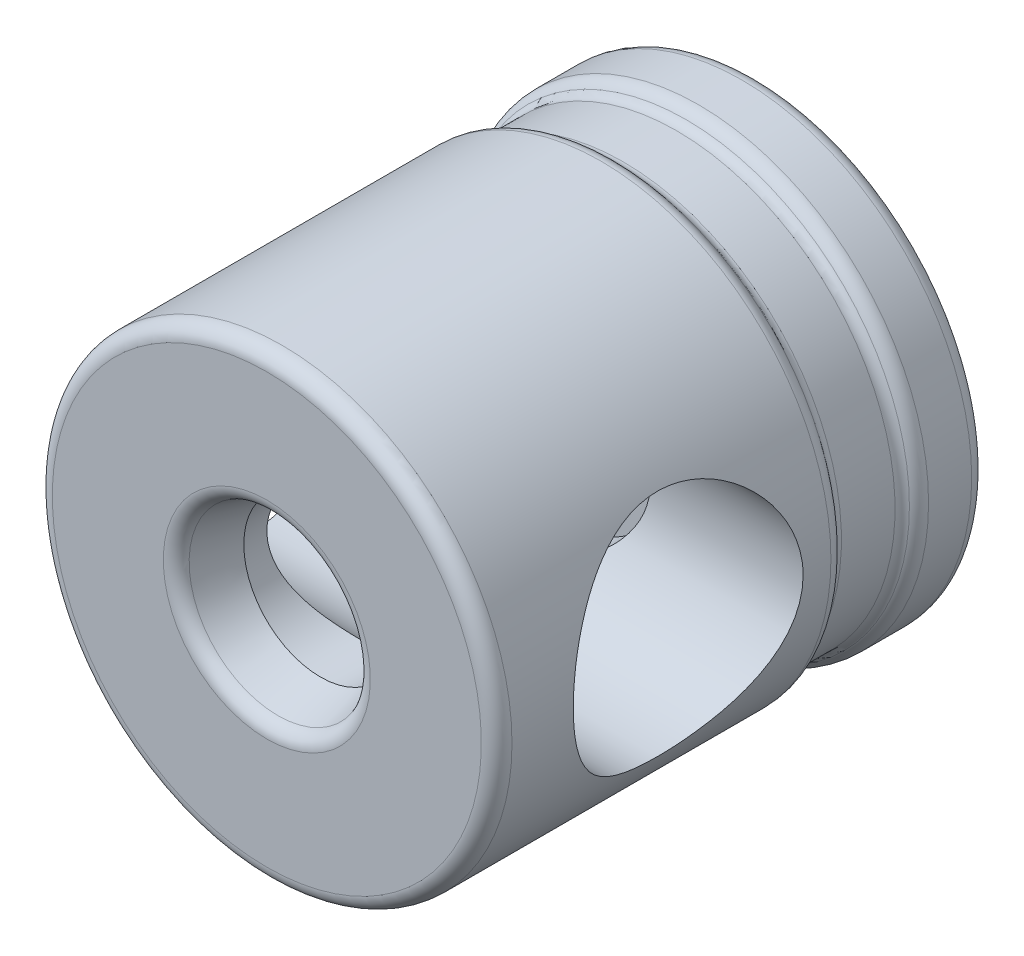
ISO-10303-21;
HEADER;
FILE_DESCRIPTION(('STEP AP214'),'2;1');
FILE_NAME('part.step','',(''),(''),'','','');
FILE_SCHEMA(('AUTOMOTIVE_DESIGN { 1 0 10303 214 1 1 1 1 }'));
ENDSEC;
DATA;
#1=APPLICATION_CONTEXT('core data for automotive mechanical design processes');
#2=APPLICATION_PROTOCOL_DEFINITION('international standard','automotive_design',2000,#1);
#3=PRODUCT_CONTEXT('',#1,'mechanical');
#4=PRODUCT('Part','Part','',(#3));
#5=PRODUCT_RELATED_PRODUCT_CATEGORY('part','',(#4));
#6=PRODUCT_DEFINITION_FORMATION('','',#4);
#7=PRODUCT_DEFINITION_CONTEXT('part definition',#1,'design');
#8=PRODUCT_DEFINITION('design','',#6,#7);
#9=PRODUCT_DEFINITION_SHAPE('','',#8);
#10=(LENGTH_UNIT() NAMED_UNIT(*) SI_UNIT(.MILLI.,.METRE.));
#11=(NAMED_UNIT(*) PLANE_ANGLE_UNIT() SI_UNIT($,.RADIAN.));
#12=(NAMED_UNIT(*) SI_UNIT($,.STERADIAN.) SOLID_ANGLE_UNIT());
#13=UNCERTAINTY_MEASURE_WITH_UNIT(LENGTH_MEASURE(1.E-05),#10,'distance_accuracy_value','');
#14=(GEOMETRIC_REPRESENTATION_CONTEXT(3) GLOBAL_UNCERTAINTY_ASSIGNED_CONTEXT((#13)) GLOBAL_UNIT_ASSIGNED_CONTEXT((#10,
#11,#12)) REPRESENTATION_CONTEXT('',''));
#15=CARTESIAN_POINT('',(0.,0.,0.));
#16=DIRECTION('',(0.,0.,1.));
#17=DIRECTION('',(1.,0.,0.));
#18=AXIS2_PLACEMENT_3D('',#15,#16,#17);
#19=CARTESIAN_POINT('',(-9.75,0.,2.5));
#20=DIRECTION('',(0.,0.,1.));
#21=DIRECTION('',(-1.,0.,0.));
#22=AXIS2_PLACEMENT_3D('',#19,#20,#21);
#23=CYLINDRICAL_SURFACE('',#22,2.75);
#24=CARTESIAN_POINT('',(-9.75,0.,0.7));
#25=DIRECTION('',(0.,0.,-1.));
#26=DIRECTION('',(1.,0.,0.));
#27=AXIS2_PLACEMENT_3D('',#24,#25,#26);
#28=CIRCLE('',#27,2.75);
#29=CARTESIAN_POINT('',(-7.,0.,0.7));
#30=VERTEX_POINT('',#29);
#31=EDGE_CURVE('E24',#30,#30,#28,.F.);
#32=ORIENTED_EDGE('',*,*,#31,.T.);
#33=EDGE_LOOP('',(#32));
#34=FACE_BOUND('',#33,.T.);
#35=CARTESIAN_POINT('',(-9.75,0.,2.5));
#36=DIRECTION('',(0.,0.,1.));
#37=DIRECTION('',(-1.,0.,0.));
#38=AXIS2_PLACEMENT_3D('',#35,#36,#37);
#39=CIRCLE('',#38,2.75);
#40=CARTESIAN_POINT('',(-12.5,0.,2.5));
#41=VERTEX_POINT('',#40);
#42=EDGE_CURVE('E771',#41,#41,#39,.T.);
#43=ORIENTED_EDGE('',*,*,#42,.F.);
#44=EDGE_LOOP('',(#43));
#45=FACE_BOUND('',#44,.T.);
#46=ADVANCED_FACE('F14',(#34,#45),#23,.T.);
#47=CARTESIAN_POINT('',(-9.75,0.,0.5));
#48=DIRECTION('',(0.,0.,-1.));
#49=DIRECTION('',(1.,0.,0.));
#50=AXIS2_PLACEMENT_3D('',#47,#48,#49);
#51=PLANE('',#50);
#52=CARTESIAN_POINT('',(-9.75,0.,0.5));
#53=DIRECTION('',(0.,0.,-1.));
#54=DIRECTION('',(1.,0.,0.));
#55=AXIS2_PLACEMENT_3D('',#52,#53,#54);
#56=CIRCLE('',#55,2.55);
#57=CARTESIAN_POINT('',(-7.2,0.,0.5));
#58=VERTEX_POINT('',#57);
#59=EDGE_CURVE('E9',#58,#58,#56,.T.);
#60=ORIENTED_EDGE('',*,*,#59,.T.);
#61=EDGE_LOOP('',(#60));
#62=FACE_BOUND('',#61,.T.);
#63=DIRECTION('',(-0.499999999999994,0.866025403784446,0.));
#64=VECTOR('',#63,1.);
#65=CARTESIAN_POINT('',(-10.3273502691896,-0.999999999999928,0.5));
#66=LINE('',#65,#64);
#67=CARTESIAN_POINT('',(-10.3273502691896,-0.999999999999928,0.5));
#68=VERTEX_POINT('',#67);
#69=CARTESIAN_POINT('',(-10.9047005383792,0.,0.5));
#70=VERTEX_POINT('',#69);
#71=EDGE_CURVE('E33',#68,#70,#66,.T.);
#72=ORIENTED_EDGE('',*,*,#71,.F.);
#73=DIRECTION('',(-1.,0.,0.));
#74=VECTOR('',#73,1.);
#75=CARTESIAN_POINT('',(-9.17264973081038,-0.999999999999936,0.5));
#76=LINE('',#75,#74);
#77=CARTESIAN_POINT('',(-9.17264973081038,-0.999999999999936,0.5));
#78=VERTEX_POINT('',#77);
#79=EDGE_CURVE('E791',#78,#68,#76,.T.);
#80=ORIENTED_EDGE('',*,*,#79,.F.);
#81=DIRECTION('',(-0.500000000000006,-0.86602540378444,0.));
#82=VECTOR('',#81,1.);
#83=CARTESIAN_POINT('',(-8.59529946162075,0.,0.5));
#84=LINE('',#83,#82);
#85=CARTESIAN_POINT('',(-8.59529946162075,0.,0.5));
#86=VERTEX_POINT('',#85);
#87=EDGE_CURVE('E795',#86,#78,#84,.T.);
#88=ORIENTED_EDGE('',*,*,#87,.F.);
#89=DIRECTION('',(0.499999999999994,-0.866025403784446,0.));
#90=VECTOR('',#89,1.);
#91=CARTESIAN_POINT('',(-9.17264973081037,1.00000000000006,0.5));
#92=LINE('',#91,#90);
#93=CARTESIAN_POINT('',(-9.17264973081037,1.00000000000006,0.5));
#94=VERTEX_POINT('',#93);
#95=EDGE_CURVE('E798',#94,#86,#92,.T.);
#96=ORIENTED_EDGE('',*,*,#95,.F.);
#97=DIRECTION('',(1.,0.,0.));
#98=VECTOR('',#97,1.);
#99=CARTESIAN_POINT('',(-10.3273502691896,1.00000000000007,0.5));
#100=LINE('',#99,#98);
#101=CARTESIAN_POINT('',(-10.3273502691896,1.00000000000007,0.5));
#102=VERTEX_POINT('',#101);
#103=EDGE_CURVE('E801',#102,#94,#100,.T.);
#104=ORIENTED_EDGE('',*,*,#103,.F.);
#105=DIRECTION('',(0.500000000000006,0.86602540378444,0.));
#106=VECTOR('',#105,1.);
#107=CARTESIAN_POINT('',(-10.9047005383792,0.,0.5));
#108=LINE('',#107,#106);
#109=EDGE_CURVE('E804',#70,#102,#108,.T.);
#110=ORIENTED_EDGE('',*,*,#109,.F.);
#111=EDGE_LOOP('',(#72,#80,#88,#96,#104,#110));
#112=FACE_BOUND('',#111,.T.);
#113=ADVANCED_FACE('F661',(#62,#112),#51,.T.);
#114=CARTESIAN_POINT('',(-10.3273502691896,-0.999999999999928,2.));
#115=DIRECTION('',(-0.866025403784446,-0.499999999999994,0.));
#116=DIRECTION('',(-0.499999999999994,0.866025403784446,0.));
#117=AXIS2_PLACEMENT_3D('',#114,#115,#116);
#118=PLANE('',#117);
#119=ORIENTED_EDGE('',*,*,#71,.T.);
#120=DIRECTION('',(0.,0.,-1.));
#121=VECTOR('',#120,1.);
#122=CARTESIAN_POINT('',(-10.9047005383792,0.,2.));
#123=LINE('',#122,#121);
#124=CARTESIAN_POINT('',(-10.9047005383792,0.,2.));
#125=VERTEX_POINT('',#124);
#126=EDGE_CURVE('E775',#125,#70,#123,.T.);
#127=ORIENTED_EDGE('',*,*,#126,.F.);
#128=DIRECTION('',(-0.499999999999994,0.866025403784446,0.));
#129=VECTOR('',#128,1.);
#130=CARTESIAN_POINT('',(-10.3273502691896,-0.999999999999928,2.));
#131=LINE('',#130,#129);
#132=CARTESIAN_POINT('',(-10.3273502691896,-0.999999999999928,2.));
#133=VERTEX_POINT('',#132);
#134=EDGE_CURVE('E794',#133,#125,#131,.T.);
#135=ORIENTED_EDGE('',*,*,#134,.F.);
#136=DIRECTION('',(0.,0.,-1.));
#137=VECTOR('',#136,1.);
#138=CARTESIAN_POINT('',(-10.3273502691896,-0.999999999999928,2.));
#139=LINE('',#138,#137);
#140=EDGE_CURVE('E774',#133,#68,#139,.T.);
#141=ORIENTED_EDGE('',*,*,#140,.T.);
#142=EDGE_LOOP('',(#119,#127,#135,#141));
#143=FACE_BOUND('',#142,.T.);
#144=ADVANCED_FACE('F671',(#143),#118,.F.);
#145=CARTESIAN_POINT('',(-9.17264973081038,-0.999999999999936,2.));
#146=DIRECTION('',(0.,-1.,0.));
#147=DIRECTION('',(-1.,0.,0.));
#148=AXIS2_PLACEMENT_3D('',#145,#146,#147);
#149=PLANE('',#148);
#150=ORIENTED_EDGE('',*,*,#79,.T.);
#151=ORIENTED_EDGE('',*,*,#140,.F.);
#152=DIRECTION('',(-1.,0.,0.));
#153=VECTOR('',#152,1.);
#154=CARTESIAN_POINT('',(-9.17264973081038,-0.999999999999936,2.));
#155=LINE('',#154,#153);
#156=CARTESIAN_POINT('',(-9.17264973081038,-0.999999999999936,2.));
#157=VERTEX_POINT('',#156);
#158=EDGE_CURVE('E778',#157,#133,#155,.T.);
#159=ORIENTED_EDGE('',*,*,#158,.F.);
#160=DIRECTION('',(0.,0.,-1.));
#161=VECTOR('',#160,1.);
#162=CARTESIAN_POINT('',(-9.17264973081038,-0.999999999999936,2.));
#163=LINE('',#162,#161);
#164=EDGE_CURVE('E787',#157,#78,#163,.T.);
#165=ORIENTED_EDGE('',*,*,#164,.T.);
#166=EDGE_LOOP('',(#150,#151,#159,#165));
#167=FACE_BOUND('',#166,.T.);
#168=ADVANCED_FACE('F681',(#167),#149,.F.);
#169=CARTESIAN_POINT('',(-8.59529946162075,0.,2.));
#170=DIRECTION('',(0.86602540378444,-0.500000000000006,0.));
#171=DIRECTION('',(-0.500000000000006,-0.86602540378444,0.));
#172=AXIS2_PLACEMENT_3D('',#169,#170,#171);
#173=PLANE('',#172);
#174=ORIENTED_EDGE('',*,*,#87,.T.);
#175=ORIENTED_EDGE('',*,*,#164,.F.);
#176=DIRECTION('',(-0.500000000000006,-0.86602540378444,0.));
#177=VECTOR('',#176,1.);
#178=CARTESIAN_POINT('',(-8.59529946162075,0.,2.));
#179=LINE('',#178,#177);
#180=CARTESIAN_POINT('',(-8.59529946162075,0.,2.));
#181=VERTEX_POINT('',#180);
#182=EDGE_CURVE('E810',#181,#157,#179,.T.);
#183=ORIENTED_EDGE('',*,*,#182,.F.);
#184=DIRECTION('',(0.,0.,-1.));
#185=VECTOR('',#184,1.);
#186=CARTESIAN_POINT('',(-8.59529946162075,0.,2.));
#187=LINE('',#186,#185);
#188=EDGE_CURVE('E784',#181,#86,#187,.T.);
#189=ORIENTED_EDGE('',*,*,#188,.T.);
#190=EDGE_LOOP('',(#174,#175,#183,#189));
#191=FACE_BOUND('',#190,.T.);
#192=ADVANCED_FACE('F710',(#191),#173,.F.);
#193=CARTESIAN_POINT('',(-9.17264973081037,1.00000000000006,2.));
#194=DIRECTION('',(0.866025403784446,0.499999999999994,0.));
#195=DIRECTION('',(0.499999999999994,-0.866025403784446,0.));
#196=AXIS2_PLACEMENT_3D('',#193,#194,#195);
#197=PLANE('',#196);
#198=ORIENTED_EDGE('',*,*,#95,.T.);
#199=ORIENTED_EDGE('',*,*,#188,.F.);
#200=DIRECTION('',(0.499999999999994,-0.866025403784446,0.));
#201=VECTOR('',#200,1.);
#202=CARTESIAN_POINT('',(-9.17264973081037,1.00000000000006,2.));
#203=LINE('',#202,#201);
#204=CARTESIAN_POINT('',(-9.17264973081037,1.00000000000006,2.));
#205=VERTEX_POINT('',#204);
#206=EDGE_CURVE('E813',#205,#181,#203,.T.);
#207=ORIENTED_EDGE('',*,*,#206,.F.);
#208=DIRECTION('',(0.,0.,-1.));
#209=VECTOR('',#208,1.);
#210=CARTESIAN_POINT('',(-9.17264973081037,1.00000000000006,2.));
#211=LINE('',#210,#209);
#212=EDGE_CURVE('E781',#205,#94,#211,.T.);
#213=ORIENTED_EDGE('',*,*,#212,.T.);
#214=EDGE_LOOP('',(#198,#199,#207,#213));
#215=FACE_BOUND('',#214,.T.);
#216=ADVANCED_FACE('F700',(#215),#197,.F.);
#217=CARTESIAN_POINT('',(-10.3273502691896,1.00000000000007,2.));
#218=DIRECTION('',(0.,1.,0.));
#219=DIRECTION('',(1.,0.,0.));
#220=AXIS2_PLACEMENT_3D('',#217,#218,#219);
#221=PLANE('',#220);
#222=ORIENTED_EDGE('',*,*,#103,.T.);
#223=ORIENTED_EDGE('',*,*,#212,.F.);
#224=DIRECTION('',(1.,0.,0.));
#225=VECTOR('',#224,1.);
#226=CARTESIAN_POINT('',(-10.3273502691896,1.00000000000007,2.));
#227=LINE('',#226,#225);
#228=CARTESIAN_POINT('',(-10.3273502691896,1.00000000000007,2.));
#229=VERTEX_POINT('',#228);
#230=EDGE_CURVE('E816',#229,#205,#227,.T.);
#231=ORIENTED_EDGE('',*,*,#230,.F.);
#232=DIRECTION('',(0.,0.,-1.));
#233=VECTOR('',#232,1.);
#234=CARTESIAN_POINT('',(-10.3273502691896,1.00000000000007,2.));
#235=LINE('',#234,#233);
#236=EDGE_CURVE('E777',#229,#102,#235,.T.);
#237=ORIENTED_EDGE('',*,*,#236,.T.);
#238=EDGE_LOOP('',(#222,#223,#231,#237));
#239=FACE_BOUND('',#238,.T.);
#240=ADVANCED_FACE('F690',(#239),#221,.F.);
#241=CARTESIAN_POINT('',(-10.9047005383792,0.,2.));
#242=DIRECTION('',(-0.86602540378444,0.500000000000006,0.));
#243=DIRECTION('',(0.500000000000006,0.866025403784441,0.));
#244=AXIS2_PLACEMENT_3D('',#241,#242,#243);
#245=PLANE('',#244);
#246=ORIENTED_EDGE('',*,*,#109,.T.);
#247=ORIENTED_EDGE('',*,*,#236,.F.);
#248=DIRECTION('',(0.500000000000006,0.86602540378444,0.));
#249=VECTOR('',#248,1.);
#250=CARTESIAN_POINT('',(-10.9047005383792,0.,2.));
#251=LINE('',#250,#249);
#252=EDGE_CURVE('E819',#125,#229,#251,.T.);
#253=ORIENTED_EDGE('',*,*,#252,.F.);
#254=ORIENTED_EDGE('',*,*,#126,.T.);
#255=EDGE_LOOP('',(#246,#247,#253,#254));
#256=FACE_BOUND('',#255,.T.);
#257=ADVANCED_FACE('F649',(#256),#245,.F.);
#258=CARTESIAN_POINT('',(-10.9047005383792,0.,2.));
#259=DIRECTION('',(0.,0.,-1.));
#260=DIRECTION('',(1.,0.,0.));
#261=AXIS2_PLACEMENT_3D('',#258,#259,#260);
#262=PLANE('',#261);
#263=ORIENTED_EDGE('',*,*,#134,.T.);
#264=ORIENTED_EDGE('',*,*,#252,.T.);
#265=ORIENTED_EDGE('',*,*,#230,.T.);
#266=ORIENTED_EDGE('',*,*,#206,.T.);
#267=ORIENTED_EDGE('',*,*,#182,.T.);
#268=ORIENTED_EDGE('',*,*,#158,.T.);
#269=EDGE_LOOP('',(#263,#264,#265,#266,#267,#268));
#270=FACE_BOUND('',#269,.T.);
#271=ADVANCED_FACE('F640',(#270),#262,.T.);
#272=CARTESIAN_POINT('',(-9.75,0.,0.7));
#273=DIRECTION('',(0.,0.,1.));
#274=DIRECTION('',(-1.,0.,0.));
#275=AXIS2_PLACEMENT_3D('',#272,#273,#274);
#276=CONICAL_SURFACE('',#275,2.75,0.785398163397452);
#277=ORIENTED_EDGE('',*,*,#59,.F.);
#278=EDGE_LOOP('',(#277));
#279=FACE_BOUND('',#278,.T.);
#280=ORIENTED_EDGE('',*,*,#31,.F.);
#281=EDGE_LOOP('',(#280));
#282=FACE_BOUND('',#281,.T.);
#283=ADVANCED_FACE('F265',(#279,#282),#276,.T.);
#284=CARTESIAN_POINT('',(0.,0.,31.));
#285=DIRECTION('',(0.,0.,1.));
#286=DIRECTION('',(0.,-1.,0.));
#287=AXIS2_PLACEMENT_3D('',#284,#285,#286);
#288=TOROIDAL_SURFACE('',#287,6.75641905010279,1.);
#289=CARTESIAN_POINT('',(0.,0.,31.275637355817));
#290=DIRECTION('',(0.,0.,1.));
#291=DIRECTION('',(0.,-1.,0.));
#292=AXIS2_PLACEMENT_3D('',#289,#290,#291);
#293=CIRCLE('',#292,5.79515735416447);
#294=CARTESIAN_POINT('',(0.,-5.79515735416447,31.275637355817));
#295=VERTEX_POINT('',#294);
#296=EDGE_CURVE('E103',#295,#295,#293,.T.);
#297=ORIENTED_EDGE('',*,*,#296,.F.);
#298=EDGE_LOOP('',(#297));
#299=FACE_BOUND('',#298,.T.);
#300=CARTESIAN_POINT('',(0.,0.,32.));
#301=DIRECTION('',(0.,0.,1.));
#302=DIRECTION('',(0.,-1.,0.));
#303=AXIS2_PLACEMENT_3D('',#300,#301,#302);
#304=CIRCLE('',#303,6.75641905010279);
#305=CARTESIAN_POINT('',(0.,-6.75641905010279,32.));
#306=VERTEX_POINT('',#305);
#307=EDGE_CURVE('E108',#306,#306,#304,.F.);
#308=ORIENTED_EDGE('',*,*,#307,.F.);
#309=EDGE_LOOP('',(#308));
#310=FACE_BOUND('',#309,.T.);
#311=ADVANCED_FACE('F16',(#299,#310),#288,.T.);
#312=CARTESIAN_POINT('',(5.,0.,32.));
#313=DIRECTION('',(0.,0.,1.));
#314=DIRECTION('',(0.,-1.,0.));
#315=AXIS2_PLACEMENT_3D('',#312,#313,#314);
#316=PLANE('',#315);
#317=ORIENTED_EDGE('',*,*,#307,.T.);
#318=EDGE_LOOP('',(#317));
#319=FACE_BOUND('',#318,.T.);
#320=CARTESIAN_POINT('',(0.,0.,32.));
#321=DIRECTION('',(0.,0.,1.));
#322=DIRECTION('',(0.,-1.,0.));
#323=AXIS2_PLACEMENT_3D('',#320,#321,#322);
#324=CIRCLE('',#323,14.);
#325=CARTESIAN_POINT('',(0.,-14.,32.));
#326=VERTEX_POINT('',#325);
#327=EDGE_CURVE('E421',#326,#326,#324,.T.);
#328=ORIENTED_EDGE('',*,*,#327,.T.);
#329=EDGE_LOOP('',(#328));
#330=FACE_BOUND('',#329,.T.);
#331=ADVANCED_FACE('F219',(#319,#330),#316,.T.);
#332=CARTESIAN_POINT('',(0.,0.,28.5025941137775));
#333=DIRECTION('',(0.,0.,1.));
#334=DIRECTION('',(0.,-1.,0.));
#335=AXIS2_PLACEMENT_3D('',#332,#333,#334);
#336=CONICAL_SURFACE('',#335,5.,0.279252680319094);
#337=ORIENTED_EDGE('',*,*,#296,.T.);
#338=EDGE_LOOP('',(#337));
#339=FACE_BOUND('',#338,.T.);
#340=CARTESIAN_POINT('',(0.,0.,28.5025941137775));
#341=DIRECTION('',(0.,0.,-1.));
#342=DIRECTION('',(0.,1.,0.));
#343=AXIS2_PLACEMENT_3D('',#340,#341,#342);
#344=CIRCLE('',#343,5.);
#345=CARTESIAN_POINT('',(0.,5.,28.5025941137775));
#346=VERTEX_POINT('',#345);
#347=EDGE_CURVE('E164',#346,#346,#344,.T.);
#348=ORIENTED_EDGE('',*,*,#347,.T.);
#349=EDGE_LOOP('',(#348));
#350=FACE_BOUND('',#349,.T.);
#351=ADVANCED_FACE('F195',(#339,#350),#336,.F.);
#352=CARTESIAN_POINT('',(0.,0.,31.));
#353=DIRECTION('',(0.,0.,1.));
#354=DIRECTION('',(0.,-1.,0.));
#355=AXIS2_PLACEMENT_3D('',#352,#353,#354);
#356=TOROIDAL_SURFACE('',#355,14.,1.);
#357=ORIENTED_EDGE('',*,*,#327,.F.);
#358=EDGE_LOOP('',(#357));
#359=FACE_BOUND('',#358,.T.);
#360=CARTESIAN_POINT('',(0.,0.,31.));
#361=DIRECTION('',(0.,0.,1.));
#362=DIRECTION('',(0.,-1.,0.));
#363=AXIS2_PLACEMENT_3D('',#360,#361,#362);
#364=CIRCLE('',#363,15.);
#365=CARTESIAN_POINT('',(0.,-15.,31.));
#366=VERTEX_POINT('',#365);
#367=EDGE_CURVE('E377',#366,#366,#364,.F.);
#368=ORIENTED_EDGE('',*,*,#367,.F.);
#369=EDGE_LOOP('',(#368));
#370=FACE_BOUND('',#369,.T.);
#371=ADVANCED_FACE('F216',(#359,#370),#356,.T.);
#372=CARTESIAN_POINT('',(0.,0.,0.));
#373=DIRECTION('',(0.,0.,-1.));
#374=DIRECTION('',(0.,1.,0.));
#375=AXIS2_PLACEMENT_3D('',#372,#373,#374);
#376=CYLINDRICAL_SURFACE('',#375,5.);
#377=ORIENTED_EDGE('',*,*,#347,.F.);
#378=EDGE_LOOP('',(#377));
#379=FACE_BOUND('',#378,.T.);
#380=CARTESIAN_POINT('',(0.,5.,25.0901699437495));
#381=CARTESIAN_POINT('',(0.122053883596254,4.99999964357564,25.0901706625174));
#382=CARTESIAN_POINT('',(0.244117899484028,4.99552162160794,25.0941853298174));
#383=CARTESIAN_POINT('',(0.487088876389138,4.97770938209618,25.1100399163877));
#384=CARTESIAN_POINT('',(0.607995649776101,4.96437375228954,25.1218810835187));
#385=CARTESIAN_POINT('',(0.847752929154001,4.92909864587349,25.1528341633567));
#386=CARTESIAN_POINT('',(0.966600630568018,4.90714827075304,25.1719552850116));
#387=CARTESIAN_POINT('',(1.20127131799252,4.85504058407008,25.2166209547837));
#388=CARTESIAN_POINT('',(1.31709272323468,4.82487907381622,25.2421687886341));
#389=CARTESIAN_POINT('',(1.65668003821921,4.72342806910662,25.3263966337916));
#390=CARTESIAN_POINT('',(1.8751813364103,4.64077239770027,25.3930362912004));
#391=CARTESIAN_POINT('',(2.2947024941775,4.44834576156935,25.5396051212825));
#392=CARTESIAN_POINT('',(2.49571871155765,4.33856916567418,25.6195370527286));
#393=CARTESIAN_POINT('',(2.9091252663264,4.07504436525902,25.7986599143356));
#394=CARTESIAN_POINT('',(3.11841562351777,3.91711146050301,25.8989119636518));
#395=CARTESIAN_POINT('',(3.41205464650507,3.65718550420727,26.0486695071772));
#396=CARTESIAN_POINT('',(3.506617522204,3.56662594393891,26.09852398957));
#397=CARTESIAN_POINT('',(3.68868505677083,3.3779849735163,26.1970534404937));
#398=CARTESIAN_POINT('',(3.77618827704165,3.27990203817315,26.2457281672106));
#399=CARTESIAN_POINT('',(3.95581205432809,3.06174885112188,26.3477897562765));
#400=CARTESIAN_POINT('',(4.04676291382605,2.94055246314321,26.4008367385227));
#401=CARTESIAN_POINT('',(4.21797779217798,2.68919540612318,26.5026138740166));
#402=CARTESIAN_POINT('',(4.2982463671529,2.55903859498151,26.5513458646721));
#403=CARTESIAN_POINT('',(4.44719011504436,2.29042949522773,26.6431128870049));
#404=CARTESIAN_POINT('',(4.51587183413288,2.15198195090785,26.6861511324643));
#405=CARTESIAN_POINT('',(4.64069315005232,1.86763465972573,26.7652391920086));
#406=CARTESIAN_POINT('',(4.69683543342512,1.72173651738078,26.8012905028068));
#407=CARTESIAN_POINT('',(4.79005883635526,1.44040606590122,26.8616268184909));
#408=CARTESIAN_POINT('',(4.82857099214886,1.30563322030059,26.8867776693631));
#409=CARTESIAN_POINT('',(4.89430447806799,1.03224885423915,26.9299124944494));
#410=CARTESIAN_POINT('',(4.92152801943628,0.893638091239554,26.9478978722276));
#411=CARTESIAN_POINT('',(4.96417435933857,0.613972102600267,26.9761468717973));
#412=CARTESIAN_POINT('',(4.97960875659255,0.472919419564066,26.9864180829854));
#413=CARTESIAN_POINT('',(4.9984162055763,0.189664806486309,26.9989408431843));
#414=CARTESIAN_POINT('',(5.00179095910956,0.0474630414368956,27.0011935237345));
#415=CARTESIAN_POINT('',(4.99683002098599,-0.214926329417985,26.9978871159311));
#416=CARTESIAN_POINT('',(4.99020106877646,-0.335165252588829,26.9934665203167));
#417=CARTESIAN_POINT('',(4.96833417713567,-0.574546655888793,26.9789222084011));
#418=CARTESIAN_POINT('',(4.95309371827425,-0.693688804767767,26.9687968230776));
#419=CARTESIAN_POINT('',(4.91421546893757,-0.929951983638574,26.9430706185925));
#420=CARTESIAN_POINT('',(4.89058053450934,-1.04707368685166,26.9274716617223));
#421=CARTESIAN_POINT('',(4.83522389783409,-1.27859356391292,26.8911406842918));
#422=CARTESIAN_POINT('',(4.80349905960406,-1.39299066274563,26.8704066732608));
#423=CARTESIAN_POINT('',(4.69703681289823,-1.73005538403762,26.801314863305));
#424=CARTESIAN_POINT('',(4.61081085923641,-1.94778792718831,26.7459311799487));
#425=CARTESIAN_POINT('',(4.4111078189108,-2.36556151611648,26.6205233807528));
#426=CARTESIAN_POINT('',(4.29762575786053,-2.56559932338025,26.5504965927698));
#427=CARTESIAN_POINT('',(4.03006024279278,-2.97069368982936,26.3904563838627));
#428=CARTESIAN_POINT('',(3.87260106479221,-3.17295552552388,26.2990257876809));
#429=CARTESIAN_POINT('',(3.53023339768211,-3.54999339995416,26.1099994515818));
#430=CARTESIAN_POINT('',(3.34528256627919,-3.7247261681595,26.0123943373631));
#431=CARTESIAN_POINT('',(3.03402018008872,-3.97696265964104,25.8596747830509));
#432=CARTESIAN_POINT('',(2.91589183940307,-4.06438394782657,25.8040079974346));
#433=CARTESIAN_POINT('',(2.67171142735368,-4.2289079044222,25.6948443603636));
#434=CARTESIAN_POINT('',(2.54565758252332,-4.30600825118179,25.6413479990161));
#435=CARTESIAN_POINT('',(2.15642167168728,-4.52077878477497,25.4869424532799));
#436=CARTESIAN_POINT('',(1.88155132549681,-4.64241912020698,25.3917983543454));
#437=CARTESIAN_POINT('',(1.3881299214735,-4.80833516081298,25.2565652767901));
#438=CARTESIAN_POINT('',(1.17586848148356,-4.86478068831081,25.2085135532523));
#439=CARTESIAN_POINT('',(0.850663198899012,-4.92834585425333,25.1535080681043));
#440=CARTESIAN_POINT('',(0.741160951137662,-4.94601484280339,25.1380204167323));
#441=CARTESIAN_POINT('',(0.520546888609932,-4.97407050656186,25.1132864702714));
#442=CARTESIAN_POINT('',(0.409435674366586,-4.98445983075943,25.104037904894));
#443=CARTESIAN_POINT('',(0.185899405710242,-4.997803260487,25.0921410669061));
#444=CARTESIAN_POINT('',(0.0734706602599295,-5.00072298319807,25.0895233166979));
#445=CARTESIAN_POINT('',(-0.151279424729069,-4.99897430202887,25.0910873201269));
#446=CARTESIAN_POINT('',(-0.263600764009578,-4.99430587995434,25.0952690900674));
#447=CARTESIAN_POINT('',(-0.4872904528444,-4.97746238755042,25.1102580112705));
#448=CARTESIAN_POINT('',(-0.598658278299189,-4.96528342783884,25.1210685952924));
#449=CARTESIAN_POINT('',(-0.819586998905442,-4.9336347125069,25.1488657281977));
#450=CARTESIAN_POINT('',(-0.929147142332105,-4.9141619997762,25.1658547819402));
#451=CARTESIAN_POINT('',(-1.24333934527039,-4.84750655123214,25.2232017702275));
#452=CARTESIAN_POINT('',(-1.44478192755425,-4.79115844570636,25.2708298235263));
#453=CARTESIAN_POINT('',(-1.83535294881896,-4.6555719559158,25.3807488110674));
#454=CARTESIAN_POINT('',(-2.02447722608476,-4.57632588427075,25.4430446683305));
#455=CARTESIAN_POINT('',(-2.42548680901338,-4.37908973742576,25.5902850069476));
#456=CARTESIAN_POINT('',(-2.63436573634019,-4.25652155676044,25.6772676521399));
#457=CARTESIAN_POINT('',(-3.03106833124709,-3.98379742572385,25.8565722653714));
#458=CARTESIAN_POINT('',(-3.2188659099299,-3.83360788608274,25.9489006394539));
#459=CARTESIAN_POINT('',(-3.50255251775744,-3.57120985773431,26.0961727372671));
#460=CARTESIAN_POINT('',(-3.60571345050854,-3.46704479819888,26.1516479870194));
#461=CARTESIAN_POINT('',(-3.80294572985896,-3.24948474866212,26.2605938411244));
#462=CARTESIAN_POINT('',(-3.89701969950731,-3.13609243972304,26.3140650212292));
#463=CARTESIAN_POINT('',(-4.07539802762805,-2.9005088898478,26.4176298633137));
#464=CARTESIAN_POINT('',(-4.15970669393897,-2.77832156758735,26.4677250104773));
#465=CARTESIAN_POINT('',(-4.31780642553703,-2.52561765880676,26.5632488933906));
#466=CARTESIAN_POINT('',(-4.39160060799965,-2.39510355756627,26.6086790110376));
#467=CARTESIAN_POINT('',(-4.51471647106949,-2.15224191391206,26.6854588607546));
#468=CARTESIAN_POINT('',(-4.56601641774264,-2.04121853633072,26.717837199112));
#469=CARTESIAN_POINT('',(-4.66068969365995,-1.81467232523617,26.7780969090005));
#470=CARTESIAN_POINT('',(-4.70406461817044,-1.6991504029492,26.8059791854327));
#471=CARTESIAN_POINT('',(-4.78239454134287,-1.4642485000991,26.856657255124));
#472=CARTESIAN_POINT('',(-4.81735306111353,-1.344870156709,26.8794551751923));
#473=CARTESIAN_POINT('',(-4.87841646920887,-1.10299691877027,26.9194619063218));
#474=CARTESIAN_POINT('',(-4.90452493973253,-0.980503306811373,26.936672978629));
#475=CARTESIAN_POINT('',(-4.94764012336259,-0.732635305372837,26.9651777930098));
#476=CARTESIAN_POINT('',(-4.96460331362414,-0.607250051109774,26.9764432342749));
#477=CARTESIAN_POINT('',(-4.98897876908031,-0.355144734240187,26.9926514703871));
#478=CARTESIAN_POINT('',(-4.99639101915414,-0.228424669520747,26.9975942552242));
#479=CARTESIAN_POINT('',(-5.00154563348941,0.0252924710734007,27.0010302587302));
#480=CARTESIAN_POINT('',(-4.99928857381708,0.152289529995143,26.9995238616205));
#481=CARTESIAN_POINT('',(-4.98514287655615,0.405499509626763,26.9901015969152));
#482=CARTESIAN_POINT('',(-4.97325467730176,0.531712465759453,26.9821860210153));
#483=CARTESIAN_POINT('',(-4.94124707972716,0.773178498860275,26.9609510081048));
#484=CARTESIAN_POINT('',(-4.92179225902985,0.888558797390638,26.948068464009));
#485=CARTESIAN_POINT('',(-4.87502187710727,1.11704156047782,26.9172457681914));
#486=CARTESIAN_POINT('',(-4.84770365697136,1.23014324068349,26.899303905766));
#487=CARTESIAN_POINT('',(-4.75442628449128,1.56492273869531,26.8384130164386));
#488=CARTESIAN_POINT('',(-4.67711733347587,1.78227445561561,26.7883802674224));
#489=CARTESIAN_POINT('',(-4.4901470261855,2.21290412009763,26.6697911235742));
#490=CARTESIAN_POINT('',(-4.37887251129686,2.42521863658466,26.6003304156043));
#491=CARTESIAN_POINT('',(-4.12962510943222,2.82887198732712,26.4493860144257));
#492=CARTESIAN_POINT('',(-3.99163624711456,3.02019816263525,26.3678951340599));
#493=CARTESIAN_POINT('',(-3.66842697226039,3.40823875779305,26.184823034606));
#494=CARTESIAN_POINT('',(-3.47919141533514,3.60106785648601,26.082097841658));
#495=CARTESIAN_POINT('',(-3.07221717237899,3.95399968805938,25.8763339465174));
#496=CARTESIAN_POINT('',(-2.85445736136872,4.11407793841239,25.7732950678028));
#497=CARTESIAN_POINT('',(-2.41032794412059,4.38783158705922,25.5846055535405));
#498=CARTESIAN_POINT('',(-2.18588450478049,4.50411638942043,25.4982279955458));
#499=CARTESIAN_POINT('',(-1.71679982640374,4.70289484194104,25.3436867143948));
#500=CARTESIAN_POINT('',(-1.47219895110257,4.78545413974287,25.2754876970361));
#501=CARTESIAN_POINT('',(-1.02303966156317,4.89840704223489,25.1797786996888));
#502=CARTESIAN_POINT('',(-0.821623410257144,4.93630728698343,25.1466004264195));
#503=CARTESIAN_POINT('',(-0.515550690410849,4.97441665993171,25.1129695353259));
#504=CARTESIAN_POINT('',(-0.412860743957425,4.98399630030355,25.1044486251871));
#505=CARTESIAN_POINT('',(-0.206782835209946,4.99678732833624,25.0930492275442));
#506=CARTESIAN_POINT('',(-0.103395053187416,5.00000030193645,25.0901693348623));
#507=CARTESIAN_POINT('',(0.,5.,25.0901699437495));
#508=B_SPLINE_CURVE_WITH_KNOTS('',3,(#380,#381,#382,#383,#384,#385,#386,#387,#388,#389,#390,
#391,#392,#393,#394,#395,#396,#397,#398,#399,#400,#401,#402,#403,#404,#405,#406,#407,#408,#409,
#410,#411,#412,#413,#414,#415,#416,#417,#418,#419,#420,#421,#422,#423,#424,#425,#426,#427,#428,
#429,#430,#431,#432,#433,#434,#435,#436,#437,#438,#439,#440,#441,#442,#443,#444,#445,#446,#447,
#448,#449,#450,#451,#452,#453,#454,#455,#456,#457,#458,#459,#460,#461,#462,#463,#464,#465,#466,
#467,#468,#469,#470,#471,#472,#473,#474,#475,#476,#477,#478,#479,#480,#481,#482,#483,#484,#485,
#486,#487,#488,#489,#490,#491,#492,#493,#494,#495,#496,#497,#498,#499,#500,#501,#502,#503,#504,
#505,#506,#507),.UNSPECIFIED.,.T.,.F.,(4,2,2,2,2,2,2,2,2,2,2,2,2,2,2,2,2,2,2,2,2,2,2,2,2,2,2,2,
2,2,2,2,2,2,2,2,2,2,2,2,2,2,2,2,2,2,2,2,2,2,2,2,2,2,2,2,2,2,2,2,2,2,2,4),(0.,0.366033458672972,
0.732125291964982,1.09868176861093,1.46542603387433,2.19101005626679,2.91674485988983,
3.75544535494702,4.17545267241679,4.59554536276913,5.07654048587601,5.55732979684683,
6.03784656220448,6.51826027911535,6.94483544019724,7.37132700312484,7.79739842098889,
8.22340971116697,8.5844789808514,8.94565394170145,9.30670613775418,9.66789850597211,
10.3866783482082,11.1055894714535,11.9189706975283,12.7336179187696,13.2045491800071,
13.6755861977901,14.6151303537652,15.2867708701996,15.622382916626,15.9578727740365,
16.2949041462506,16.6319363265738,16.9691431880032,17.3064869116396,17.9474746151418,
18.5886777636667,19.3580440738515,20.1283522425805,20.5981214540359,21.0677546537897,
21.5371798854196,22.0064656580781,22.3856357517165,22.7647294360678,23.1436642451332,
23.5224454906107,23.9030138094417,24.2835827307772,24.664128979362,25.0446579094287,
25.3973949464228,25.7502513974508,26.4553650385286,27.2012784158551,27.9476392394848,
28.8113869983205,29.6757781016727,30.4741849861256,31.2710302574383,31.891247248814,
32.201401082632,32.5114776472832),.UNSPECIFIED.);
#509=CARTESIAN_POINT('',(0.,5.,25.0901699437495));
#510=VERTEX_POINT('',#509);
#511=EDGE_CURVE('E177',#510,#510,#508,.T.);
#512=ORIENTED_EDGE('',*,*,#511,.T.);
#513=EDGE_LOOP('',(#512));
#514=FACE_BOUND('',#513,.T.);
#515=ADVANCED_FACE('F212',(#379,#514),#376,.F.);
#516=CARTESIAN_POINT('',(0.,0.,0.));
#517=DIRECTION('',(0.,0.,-1.));
#518=DIRECTION('',(0.,1.,0.));
#519=AXIS2_PLACEMENT_3D('',#516,#517,#518);
#520=CYLINDRICAL_SURFACE('',#519,15.);
#521=CARTESIAN_POINT('',(0.,0.,10.1861406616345));
#522=DIRECTION('',(0.,0.,1.));
#523=DIRECTION('',(0.,-1.,0.));
#524=AXIS2_PLACEMENT_3D('',#521,#522,#523);
#525=CIRCLE('',#524,15.);
#526=CARTESIAN_POINT('',(0.,-15.,10.1861406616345));
#527=VERTEX_POINT('',#526);
#528=EDGE_CURVE('E395',#527,#527,#525,.T.);
#529=ORIENTED_EDGE('',*,*,#528,.T.);
#530=EDGE_LOOP('',(#529));
#531=FACE_BOUND('',#530,.T.);
#532=CARTESIAN_POINT('',(-12.9903810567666,-7.5,19.5));
#533=CARTESIAN_POINT('',(-12.990382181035,-7.49999915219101,19.3045027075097));
#534=CARTESIAN_POINT('',(-12.9948093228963,-7.49234594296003,19.1089883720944));
#535=CARTESIAN_POINT('',(-13.0123535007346,-7.46183346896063,18.719466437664));
#536=CARTESIAN_POINT('',(-13.0254745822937,-7.43896712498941,18.5254595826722));
#537=CARTESIAN_POINT('',(-13.0599426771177,-7.37828654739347,18.1402324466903));
#538=CARTESIAN_POINT('',(-13.0813025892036,-7.34044887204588,17.9490170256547));
#539=CARTESIAN_POINT('',(-13.1314907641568,-7.25028327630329,17.5709635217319));
#540=CARTESIAN_POINT('',(-13.1603222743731,-7.19794905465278,17.3841273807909));
#541=CARTESIAN_POINT('',(-13.2243001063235,-7.0797153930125,17.0171446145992));
#542=CARTESIAN_POINT('',(-13.2594088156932,-7.0138964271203,16.8369654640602));
#543=CARTESIAN_POINT('',(-13.3349831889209,-6.86912607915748,16.4830973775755));
#544=CARTESIAN_POINT('',(-13.3754509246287,-6.79016961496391,16.3094109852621));
#545=CARTESIAN_POINT('',(-13.5031657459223,-6.53458165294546,15.7995135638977));
#546=CARTESIAN_POINT('',(-13.5967885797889,-6.33911850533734,15.4741170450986));
#547=CARTESIAN_POINT('',(-13.7997722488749,-5.88499039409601,14.832657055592));
#548=CARTESIAN_POINT('',(-13.9097942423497,-5.62244233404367,14.5195769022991));
#549=CARTESIAN_POINT('',(-14.1279092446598,-5.04935146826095,13.9394166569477));
#550=CARTESIAN_POINT('',(-14.236001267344,-4.73878486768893,13.6723595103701));
#551=CARTESIAN_POINT('',(-14.3922677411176,-4.23049481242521,13.3031564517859));
#552=CARTESIAN_POINT('',(-14.4449049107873,-4.04756743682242,13.1821262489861));
#553=CARTESIAN_POINT('',(-14.5452036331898,-3.67082661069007,12.956054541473));
#554=CARTESIAN_POINT('',(-14.5928673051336,-3.47701785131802,12.8510062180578));
#555=CARTESIAN_POINT('',(-14.6818428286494,-3.07976082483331,12.6579355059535));
#556=CARTESIAN_POINT('',(-14.723156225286,-2.8763149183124,12.5699089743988));
#557=CARTESIAN_POINT('',(-14.7982086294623,-2.46119546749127,12.4118535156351));
#558=CARTESIAN_POINT('',(-14.8319484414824,-2.24952279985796,12.3418226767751));
#559=CARTESIAN_POINT('',(-14.8887046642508,-1.83496193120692,12.224978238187));
#560=CARTESIAN_POINT('',(-14.9123131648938,-1.63251998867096,12.1768674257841));
#561=CARTESIAN_POINT('',(-14.9514227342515,-1.22357492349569,12.0975520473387));
#562=CARTESIAN_POINT('',(-14.9669241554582,-1.01707197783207,12.0663467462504));
#563=CARTESIAN_POINT('',(-14.9893635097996,-0.601825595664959,12.0212701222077));
#564=CARTESIAN_POINT('',(-14.9963058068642,-0.3930833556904,12.007389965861));
#565=CARTESIAN_POINT('',(-15.0014351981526,0.0249331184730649,11.9971285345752));
#566=CARTESIAN_POINT('',(-14.9996228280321,0.234207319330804,12.0007461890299));
#567=CARTESIAN_POINT('',(-14.9878390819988,0.633235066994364,12.0243456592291));
#568=CARTESIAN_POINT('',(-14.9785935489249,0.823098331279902,12.0428718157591));
#569=CARTESIAN_POINT('',(-14.953081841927,1.20046493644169,12.0942485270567));
#570=CARTESIAN_POINT('',(-14.9368132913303,1.38796745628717,12.1271039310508));
#571=CARTESIAN_POINT('',(-14.8976520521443,1.75920233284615,12.206767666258));
#572=CARTESIAN_POINT('',(-14.8747616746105,1.9429359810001,12.2535711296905));
#573=CARTESIAN_POINT('',(-14.8228789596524,2.30560974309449,12.3606769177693));
#574=CARTESIAN_POINT('',(-14.793884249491,2.48454796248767,12.4209844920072));
#575=CARTESIAN_POINT('',(-14.7300206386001,2.83889506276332,12.5554296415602));
#576=CARTESIAN_POINT('',(-14.695078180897,3.01422444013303,12.6297418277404));
#577=CARTESIAN_POINT('',(-14.6203739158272,3.35792342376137,12.7910191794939));
#578=CARTESIAN_POINT('',(-14.5806104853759,3.52629066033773,12.8779886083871));
#579=CARTESIAN_POINT('',(-14.4553576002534,4.01963951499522,13.1568860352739));
#580=CARTESIAN_POINT('',(-14.3638660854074,4.33307864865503,13.3668837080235));
#581=CARTESIAN_POINT('',(-14.1633050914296,4.95139135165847,13.8517800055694));
#582=CARTESIAN_POINT('',(-14.0533915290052,5.25265452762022,14.1309371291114));
#583=CARTESIAN_POINT('',(-13.8889325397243,5.66743502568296,14.5834783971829));
#584=CARTESIAN_POINT('',(-13.8341410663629,5.79959345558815,14.7400881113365));
#585=CARTESIAN_POINT('',(-13.7260650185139,6.05093566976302,15.0639910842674));
#586=CARTESIAN_POINT('',(-13.6727806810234,6.17011742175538,15.2312860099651));
#587=CARTESIAN_POINT('',(-13.5658760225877,6.4019009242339,15.5867503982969));
#588=CARTESIAN_POINT('',(-13.5124515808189,6.51359631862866,15.7755706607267));
#589=CARTESIAN_POINT('',(-13.4107672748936,6.72046150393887,16.1632882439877));
#590=CARTESIAN_POINT('',(-13.3625050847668,6.81563874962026,16.3621809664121));
#591=CARTESIAN_POINT('',(-13.2729104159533,6.9885142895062,16.7688021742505));
#592=CARTESIAN_POINT('',(-13.2315738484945,7.06622290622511,16.9765253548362));
#593=CARTESIAN_POINT('',(-13.1574724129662,7.203263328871,17.3994328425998));
#594=CARTESIAN_POINT('',(-13.1247063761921,7.26259764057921,17.6146161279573));
#595=CARTESIAN_POINT('',(-13.0713934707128,7.35808542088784,18.033378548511));
#596=CARTESIAN_POINT('',(-13.0500843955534,7.39570258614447,18.2365270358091));
#597=CARTESIAN_POINT('',(-13.01682404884,7.45408812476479,18.6459943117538));
#598=CARTESIAN_POINT('',(-13.0048722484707,7.4748574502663,18.8523129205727));
#599=CARTESIAN_POINT('',(-12.9908402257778,7.49921791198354,19.2661730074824));
#600=CARTESIAN_POINT('',(-12.9887540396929,7.50281942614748,19.4737136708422));
#601=CARTESIAN_POINT('',(-12.9945291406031,7.49281311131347,19.8882321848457));
#602=CARTESIAN_POINT('',(-13.0023897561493,7.47920644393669,20.0952100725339));
#603=CARTESIAN_POINT('',(-13.0263214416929,7.43743545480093,20.4841272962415));
#604=CARTESIAN_POINT('',(-13.0413965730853,7.41103301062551,20.666321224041));
#605=CARTESIAN_POINT('',(-13.0786605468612,7.34507135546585,21.0276319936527));
#606=CARTESIAN_POINT('',(-13.1008517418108,7.30550779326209,21.2067477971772));
#607=CARTESIAN_POINT('',(-13.1516491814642,7.21365869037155,21.5607188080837));
#608=CARTESIAN_POINT('',(-13.1802545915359,7.16137480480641,21.7355745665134));
#609=CARTESIAN_POINT('',(-13.2430583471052,7.04455822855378,22.080177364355));
#610=CARTESIAN_POINT('',(-13.2772588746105,6.9800207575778,22.249922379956));
#611=CARTESIAN_POINT('',(-13.3520005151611,6.83600462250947,22.5910973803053));
#612=CARTESIAN_POINT('',(-13.392760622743,6.75597608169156,22.762247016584));
#613=CARTESIAN_POINT('',(-13.4782889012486,6.58369023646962,23.0972939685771));
#614=CARTESIAN_POINT('',(-13.523058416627,6.4914288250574,23.2611888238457));
#615=CARTESIAN_POINT('',(-13.6154877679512,6.29525608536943,23.5810486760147));
#616=CARTESIAN_POINT('',(-13.6631483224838,6.19134185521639,23.7370116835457));
#617=CARTESIAN_POINT('',(-13.7602460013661,5.97243402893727,24.0403772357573));
#618=CARTESIAN_POINT('',(-13.8096832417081,5.85743970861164,24.1877792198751));
#619=CARTESIAN_POINT('',(-13.9155491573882,5.60169452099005,24.4915182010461));
#620=CARTESIAN_POINT('',(-13.9720719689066,5.45952512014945,24.646630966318));
#621=CARTESIAN_POINT('',(-14.0844912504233,5.16258673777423,24.9444378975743));
#622=CARTESIAN_POINT('',(-14.1403878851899,5.00782116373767,25.0871354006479));
#623=CARTESIAN_POINT('',(-14.2501767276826,4.68629256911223,25.3594430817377));
#624=CARTESIAN_POINT('',(-14.30406743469,4.51952082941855,25.4890435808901));
#625=CARTESIAN_POINT('',(-14.4083960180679,4.17498562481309,25.7341130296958));
#626=CARTESIAN_POINT('',(-14.4588353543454,3.99722686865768,25.8495879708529));
#627=CARTESIAN_POINT('',(-14.5562721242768,3.62665426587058,26.068479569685));
#628=CARTESIAN_POINT('',(-14.6031397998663,3.43356346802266,26.1714863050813));
#629=CARTESIAN_POINT('',(-14.6905221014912,3.0380184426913,26.3606468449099));
#630=CARTESIAN_POINT('',(-14.7310397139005,2.83556867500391,26.4468085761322));
#631=CARTESIAN_POINT('',(-14.8045326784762,2.4227545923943,26.6013242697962));
#632=CARTESIAN_POINT('',(-14.8375115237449,2.21239399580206,26.669686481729));
#633=CARTESIAN_POINT('',(-14.8949267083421,1.78536997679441,26.7877643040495));
#634=CARTESIAN_POINT('',(-14.9193640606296,1.56870730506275,26.8374821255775));
#635=CARTESIAN_POINT('',(-14.9570987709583,1.15110375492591,26.9138921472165));
#636=CARTESIAN_POINT('',(-14.9712127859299,0.950545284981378,26.9422790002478));
#637=CARTESIAN_POINT('',(-14.9913670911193,0.547388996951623,26.9827400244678));
#638=CARTESIAN_POINT('',(-14.9974078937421,0.344791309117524,26.9948152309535));
#639=CARTESIAN_POINT('',(-15.0012472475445,-0.0607319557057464,27.0024948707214));
#640=CARTESIAN_POINT('',(-14.9990482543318,-0.263657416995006,26.9981042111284));
#641=CARTESIAN_POINT('',(-14.9864747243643,-0.668228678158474,26.9729207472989));
#642=CARTESIAN_POINT('',(-14.9761004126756,-0.86987451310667,26.9521283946));
#643=CARTESIAN_POINT('',(-14.9484141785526,-1.25700134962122,26.8963252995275));
#644=CARTESIAN_POINT('',(-14.9316070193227,-1.44266872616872,26.8623469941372));
#645=CARTESIAN_POINT('',(-14.8915068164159,-1.81031162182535,26.7806758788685));
#646=CARTESIAN_POINT('',(-14.8682115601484,-1.99228585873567,26.7329783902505));
#647=CARTESIAN_POINT('',(-14.8156777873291,-2.35129713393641,26.624364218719));
#648=CARTESIAN_POINT('',(-14.7864410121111,-2.52833560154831,26.5634514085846));
#649=CARTESIAN_POINT('',(-14.7226536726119,-2.87660018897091,26.4289275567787));
#650=CARTESIAN_POINT('',(-14.6881010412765,-3.04782401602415,26.3553115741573));
#651=CARTESIAN_POINT('',(-14.6128573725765,-3.39064537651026,26.1926097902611));
#652=CARTESIAN_POINT('',(-14.5719682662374,-3.56195129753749,26.1030006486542));
#653=CARTESIAN_POINT('',(-14.4861257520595,-3.89641126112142,25.9113309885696));
#654=CARTESIAN_POINT('',(-14.4411709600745,-4.05956249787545,25.809266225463));
#655=CARTESIAN_POINT('',(-14.3016508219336,-4.53562791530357,25.4854248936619));
#656=CARTESIAN_POINT('',(-14.2023915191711,-4.83532115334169,25.2459212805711));
#657=CARTESIAN_POINT('',(-13.9896182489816,-5.42194343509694,24.6989391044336));
#658=CARTESIAN_POINT('',(-13.8756687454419,-5.70463394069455,24.3870677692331));
#659=CARTESIAN_POINT('',(-13.7099949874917,-6.08732189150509,23.88620676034));
#660=CARTESIAN_POINT('',(-13.6556020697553,-6.20807712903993,23.7135853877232));
#661=CARTESIAN_POINT('',(-13.5501034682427,-6.43508648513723,23.3579952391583));
#662=CARTESIAN_POINT('',(-13.4989982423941,-6.5413385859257,23.1750250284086));
#663=CARTESIAN_POINT('',(-13.4001340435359,-6.74160896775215,22.793715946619));
#664=CARTESIAN_POINT('',(-13.352534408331,-6.83512717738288,22.5950726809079));
#665=CARTESIAN_POINT('',(-13.2643156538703,-7.00478946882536,22.1891046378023));
#666=CARTESIAN_POINT('',(-13.2236929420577,-7.08094249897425,21.9817843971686));
#667=CARTESIAN_POINT('',(-13.1511314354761,-7.21481348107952,21.5603914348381));
#668=CARTESIAN_POINT('',(-13.1191703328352,-7.27257885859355,21.3463376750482));
#669=CARTESIAN_POINT('',(-13.0652214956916,-7.36906123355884,20.9128609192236));
#670=CARTESIAN_POINT('',(-13.0432267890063,-7.40779154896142,20.6934417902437));
#671=CARTESIAN_POINT('',(-13.0147131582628,-7.45773453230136,20.3115033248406));
#672=CARTESIAN_POINT('',(-13.0056107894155,-7.47356894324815,20.1497637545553));
#673=CARTESIAN_POINT('',(-12.9934440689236,-7.49470238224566,19.8253534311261));
#674=CARTESIAN_POINT('',(-12.9903801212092,-7.50000070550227,19.662682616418));
#675=CARTESIAN_POINT('',(-12.9903810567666,-7.5,19.5));
#676=B_SPLINE_CURVE_WITH_KNOTS('',3,(#532,#533,#534,#535,#536,#537,#538,#539,#540,#541,#542,
#543,#544,#545,#546,#547,#548,#549,#550,#551,#552,#553,#554,#555,#556,#557,#558,#559,#560,#561,
#562,#563,#564,#565,#566,#567,#568,#569,#570,#571,#572,#573,#574,#575,#576,#577,#578,#579,#580,
#581,#582,#583,#584,#585,#586,#587,#588,#589,#590,#591,#592,#593,#594,#595,#596,#597,#598,#599,
#600,#601,#602,#603,#604,#605,#606,#607,#608,#609,#610,#611,#612,#613,#614,#615,#616,#617,#618,
#619,#620,#621,#622,#623,#624,#625,#626,#627,#628,#629,#630,#631,#632,#633,#634,#635,#636,#637,
#638,#639,#640,#641,#642,#643,#644,#645,#646,#647,#648,#649,#650,#651,#652,#653,#654,#655,#656,
#657,#658,#659,#660,#661,#662,#663,#664,#665,#666,#667,#668,#669,#670,#671,#672,#673,#674,#675),
.UNSPECIFIED.,.T.,.F.,(4,2,2,2,2,2,2,2,2,2,2,2,2,2,2,2,2,2,2,2,2,2,2,2,2,2,2,2,2,2,2,2,2,2,2,2,
2,2,2,2,2,2,2,2,2,2,2,2,2,2,2,2,2,2,2,2,2,2,2,2,2,2,2,2,2,2,2,2,2,2,2,4),(0.,0.586323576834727,
1.17292018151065,1.76043892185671,2.34821344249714,2.93257740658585,3.51716795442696,
4.68524892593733,5.94967082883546,7.21472131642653,7.89069130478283,8.5663720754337,
9.24188818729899,9.91733251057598,10.5447278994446,11.1720960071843,11.7991441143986,
12.4261538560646,12.9984442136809,13.5709283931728,14.1432130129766,14.7157204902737,
15.2959050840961,15.876285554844,17.0363679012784,18.3061098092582,18.9419219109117,
19.5778334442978,20.2543578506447,20.930576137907,21.6063937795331,22.2821192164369,
22.904329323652,23.5265042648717,24.1483030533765,24.7700598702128,25.3235688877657,
25.8772610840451,26.4308812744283,26.9847178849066,27.5639783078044,28.1434337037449,
28.7230337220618,29.3026716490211,29.9555467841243,30.6082458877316,31.2614238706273,
31.9143238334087,32.584858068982,33.2550760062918,33.9249827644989,34.5948100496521,
35.2031527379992,35.8114568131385,36.4195796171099,37.0276856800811,37.5955330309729,
38.163574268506,38.73144926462,39.2995456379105,39.8917147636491,40.4840862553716,
41.6682672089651,42.9702980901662,43.62240841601,44.2746093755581,44.9476734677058,
45.6203899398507,46.2913570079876,46.961853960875,47.4497291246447,47.9376369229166),.UNSPECIFIED.);
#677=CARTESIAN_POINT('',(-12.9903810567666,-7.5,19.5));
#678=VERTEX_POINT('',#677);
#679=EDGE_CURVE('E168',#678,#678,#676,.T.);
#680=ORIENTED_EDGE('',*,*,#679,.T.);
#681=EDGE_LOOP('',(#680));
#682=FACE_BOUND('',#681,.T.);
#683=CARTESIAN_POINT('',(15.,0.,12.));
#684=CARTESIAN_POINT('',(14.999999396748,-0.197233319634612,12.000000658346));
#685=CARTESIAN_POINT('',(14.9961007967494,-0.394480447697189,12.0077891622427));
#686=CARTESIAN_POINT('',(14.9806046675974,-0.787521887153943,12.0388543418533));
#687=CARTESIAN_POINT('',(14.9690037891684,-0.983315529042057,12.0621377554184));
#688=CARTESIAN_POINT('',(14.9383810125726,-1.37217475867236,12.1239611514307));
#689=CARTESIAN_POINT('',(14.9193485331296,-1.56523604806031,12.1625228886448));
#690=CARTESIAN_POINT('',(14.8743407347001,-1.94703954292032,12.2544760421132));
#691=CARTESIAN_POINT('',(14.8483625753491,-2.13577994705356,12.3078735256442));
#692=CARTESIAN_POINT('',(14.7902312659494,-2.50682232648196,12.4286680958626));
#693=CARTESIAN_POINT('',(14.7581053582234,-2.6891486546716,12.4960035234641));
#694=CARTESIAN_POINT('',(14.6883654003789,-3.04717071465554,12.6441754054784));
#695=CARTESIAN_POINT('',(14.6507493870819,-3.22286404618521,12.7250166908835));
#696=CARTESIAN_POINT('',(14.5309652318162,-3.73833299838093,12.9866941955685));
#697=CARTESIAN_POINT('',(14.4417945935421,-4.06690309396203,13.1868175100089));
#698=CARTESIAN_POINT('',(14.2466964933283,-4.70640207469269,13.6464383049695));
#699=CARTESIAN_POINT('',(14.1400816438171,-5.01506114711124,13.9087953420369));
#700=CARTESIAN_POINT('',(13.9784212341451,-5.44308231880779,14.3363149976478));
#701=CARTESIAN_POINT('',(13.9242051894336,-5.58001386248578,14.4846042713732));
#702=CARTESIAN_POINT('',(13.8164776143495,-5.84165491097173,14.791945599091));
#703=CARTESIAN_POINT('',(13.7629662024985,-5.96636238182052,14.9509994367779));
#704=CARTESIAN_POINT('',(13.6539394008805,-6.21203614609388,15.2918972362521));
#705=CARTESIAN_POINT('',(13.5985925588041,-6.33195448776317,15.4745513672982));
#706=CARTESIAN_POINT('',(13.492094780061,-6.5558172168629,15.8504671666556));
#707=CARTESIAN_POINT('',(13.4409420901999,-6.659768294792,16.0437243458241));
#708=CARTESIAN_POINT('',(13.3445910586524,-6.85079105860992,16.4397746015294));
#709=CARTESIAN_POINT('',(13.2993909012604,-6.93786789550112,16.6425647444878));
#710=CARTESIAN_POINT('',(13.2166574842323,-7.09420885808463,17.0564144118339));
#711=CARTESIAN_POINT('',(13.1791233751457,-7.16347495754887,17.2674730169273));
#712=CARTESIAN_POINT('',(13.1152671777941,-7.27969095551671,17.68343629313));
#713=CARTESIAN_POINT('',(13.088409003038,-7.32772731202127,17.88795469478));
#714=CARTESIAN_POINT('',(13.0439533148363,-7.40657415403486,18.3012873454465));
#715=CARTESIAN_POINT('',(13.0263554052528,-7.43738537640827,18.5101014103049));
#716=CARTESIAN_POINT('',(13.0011924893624,-7.48128583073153,18.9300109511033));
#717=CARTESIAN_POINT('',(12.993618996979,-7.49439005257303,19.1411043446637));
#718=CARTESIAN_POINT('',(12.9888194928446,-7.50270600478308,19.5637518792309));
#719=CARTESIAN_POINT('',(12.9915924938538,-7.49791944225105,19.7753059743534));
#720=CARTESIAN_POINT('',(13.0064057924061,-7.47218723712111,20.1715536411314));
#721=CARTESIAN_POINT('',(13.0172945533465,-7.4532487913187,20.356425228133));
#722=CARTESIAN_POINT('',(13.0466085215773,-7.40181622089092,20.7237294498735));
#723=CARTESIAN_POINT('',(13.065036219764,-7.3693176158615,20.9061612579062));
#724=CARTESIAN_POINT('',(13.1088213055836,-7.29114561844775,21.2672939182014));
#725=CARTESIAN_POINT('',(13.1341777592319,-7.24547400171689,21.445995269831));
#726=CARTESIAN_POINT('',(13.1910489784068,-7.14141020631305,21.798714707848));
#727=CARTESIAN_POINT('',(13.222566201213,-7.08301295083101,21.9727308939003));
#728=CARTESIAN_POINT('',(13.2916331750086,-6.952557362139,22.3190347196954));
#729=CARTESIAN_POINT('',(13.3293043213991,-6.88021734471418,22.4911919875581));
#730=CARTESIAN_POINT('',(13.4091058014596,-6.72336395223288,22.8288219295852));
#731=CARTESIAN_POINT('',(13.4512376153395,-6.63884653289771,22.9942923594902));
#732=CARTESIAN_POINT('',(13.5827161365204,-6.36789880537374,23.4795837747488));
#733=CARTESIAN_POINT('',(13.6771793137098,-6.16401254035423,23.7884440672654));
#734=CARTESIAN_POINT('',(13.8835116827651,-5.68542700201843,24.4089989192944));
#735=CARTESIAN_POINT('',(13.9960691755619,-5.40502682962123,24.716087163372));
#736=CARTESIAN_POINT('',(14.1610583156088,-4.94881247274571,25.1393628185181));
#737=CARTESIAN_POINT('',(14.2154461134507,-4.79069598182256,25.274300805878));
#738=CARTESIAN_POINT('',(14.3216433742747,-4.4631963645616,25.5310147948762));
#739=CARTESIAN_POINT('',(14.3734524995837,-4.29381176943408,25.6527890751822));
#740=CARTESIAN_POINT('',(14.4755004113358,-3.93649737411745,25.8876298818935));
#741=CARTESIAN_POINT('',(14.5255523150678,-3.74807068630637,26.0000224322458));
#742=CARTESIAN_POINT('',(14.6199518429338,-3.36104932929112,26.2083238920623));
#743=CARTESIAN_POINT('',(14.6643020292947,-3.16245928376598,26.3042402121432));
#744=CARTESIAN_POINT('',(14.7460120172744,-2.75644498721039,26.4785959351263));
#745=CARTESIAN_POINT('',(14.7833745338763,-2.54902420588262,26.5570421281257));
#746=CARTESIAN_POINT('',(14.849985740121,-2.12686703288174,26.6955380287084));
#747=CARTESIAN_POINT('',(14.8792353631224,-1.91213148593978,26.7555898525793));
#748=CARTESIAN_POINT('',(14.9266434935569,-1.49520060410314,26.8522994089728));
#749=CARTESIAN_POINT('',(14.9455200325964,-1.29343993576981,26.8904829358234));
#750=CARTESIAN_POINT('',(14.9751451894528,-0.886879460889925,26.950211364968));
#751=CARTESIAN_POINT('',(14.9858942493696,-0.682079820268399,26.9717571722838));
#752=CARTESIAN_POINT('',(14.9989557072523,-0.271216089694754,26.9979197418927));
#753=CARTESIAN_POINT('',(15.0012714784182,-0.0651525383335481,27.0025432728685));
#754=CARTESIAN_POINT('',(14.9974085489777,0.346571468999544,26.9948166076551));
#755=CARTESIAN_POINT('',(14.9912302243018,0.552231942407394,26.9824671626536));
#756=CARTESIAN_POINT('',(14.9713647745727,0.945483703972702,26.942582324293));
#757=CARTESIAN_POINT('',(14.9582993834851,1.13323569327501,26.9163034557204));
#758=CARTESIAN_POINT('',(14.9254086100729,1.5057028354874,26.8497387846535));
#759=CARTESIAN_POINT('',(14.9055809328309,1.69041693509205,26.8094482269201));
#760=CARTESIAN_POINT('',(14.8596377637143,2.05548161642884,26.7152976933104));
#761=CARTESIAN_POINT('',(14.8335242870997,2.23583357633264,26.6614420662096));
#762=CARTESIAN_POINT('',(14.7755872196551,2.59122720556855,26.5406522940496));
#763=CARTESIAN_POINT('',(14.743761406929,2.76626677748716,26.4737130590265));
#764=CARTESIAN_POINT('',(14.6741281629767,3.11487231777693,26.3252807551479));
#765=CARTESIAN_POINT('',(14.636177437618,3.28825774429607,26.2434307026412));
#766=CARTESIAN_POINT('',(14.5558172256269,3.62748137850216,26.0671873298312));
#767=CARTESIAN_POINT('',(14.5134062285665,3.79331700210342,25.9727897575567));
#768=CARTESIAN_POINT('',(14.3808355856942,4.27827609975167,25.6717923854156));
#769=CARTESIAN_POINT('',(14.2853004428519,4.58503393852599,25.4473097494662));
#770=CARTESIAN_POINT('',(14.0780904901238,5.18834638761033,24.9317245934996));
#771=CARTESIAN_POINT('',(13.9657520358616,5.48094083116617,24.6362447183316));
#772=CARTESIAN_POINT('',(13.7999731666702,5.88061884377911,24.159555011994));
#773=CARTESIAN_POINT('',(13.7451298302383,6.0073863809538,23.9949494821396));
#774=CARTESIAN_POINT('',(13.6378032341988,6.24720364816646,23.6551963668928));
#775=CARTESIAN_POINT('',(13.5853203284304,6.36025132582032,23.4800472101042));
#776=CARTESIAN_POINT('',(13.4817918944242,6.57696128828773,23.1113053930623));
#777=CARTESIAN_POINT('',(13.430941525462,6.6798962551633,22.9172297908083));
#778=CARTESIAN_POINT('',(13.3353302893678,6.86878239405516,22.519641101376));
#779=CARTESIAN_POINT('',(13.2905664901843,6.95474175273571,22.3161326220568));
#780=CARTESIAN_POINT('',(13.208855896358,7.1087077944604,21.9010876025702));
#781=CARTESIAN_POINT('',(13.1719028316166,7.17672888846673,21.6895576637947));
#782=CARTESIAN_POINT('',(13.1073420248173,7.29397564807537,21.2599625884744));
#783=CARTESIAN_POINT('',(13.0797328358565,7.3432042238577,21.0418984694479));
#784=CARTESIAN_POINT('',(13.0372695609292,7.41830673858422,20.6223564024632));
#785=CARTESIAN_POINT('',(13.021445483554,7.4459689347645,20.4212956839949));
#786=CARTESIAN_POINT('',(12.9991026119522,7.48490769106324,20.0170795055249));
#787=CARTESIAN_POINT('',(12.9925831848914,7.49618536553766,19.8139241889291));
#788=CARTESIAN_POINT('',(12.9891213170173,7.50218225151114,19.4073648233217));
#789=CARTESIAN_POINT('',(12.9921753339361,7.49690758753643,19.2039608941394));
#790=CARTESIAN_POINT('',(13.0077254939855,7.469894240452,18.7986209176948));
#791=CARTESIAN_POINT('',(13.0202212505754,7.44815623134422,18.5966848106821));
#792=CARTESIAN_POINT('',(13.0525163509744,7.39139793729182,18.21516426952));
#793=CARTESIAN_POINT('',(13.0715029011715,7.35784677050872,18.0352891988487));
#794=CARTESIAN_POINT('',(13.116176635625,7.27791219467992,17.6792033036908));
#795=CARTESIAN_POINT('',(13.1418660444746,7.23152452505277,17.5029937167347));
#796=CARTESIAN_POINT('',(13.1991699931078,7.12639386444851,17.1553269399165));
#797=CARTESIAN_POINT('',(13.230783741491,7.06765252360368,16.9838691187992));
#798=CARTESIAN_POINT('',(13.2990730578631,6.93829971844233,16.6464659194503));
#799=CARTESIAN_POINT('',(13.3357505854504,6.86768365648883,16.4805227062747));
#800=CARTESIAN_POINT('',(13.4158088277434,6.71002238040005,16.1440523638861));
#801=CARTESIAN_POINT('',(13.4594736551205,6.62219479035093,15.9739595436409));
#802=CARTESIAN_POINT('',(13.5503300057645,6.43424064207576,15.6416316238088));
#803=CARTESIAN_POINT('',(13.5975227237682,6.33410990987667,15.4793992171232));
#804=CARTESIAN_POINT('',(13.6942686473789,6.12213847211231,15.1634555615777));
#805=CARTESIAN_POINT('',(13.7438224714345,6.01029468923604,15.0097465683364));
#806=CARTESIAN_POINT('',(13.8441367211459,5.77548095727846,14.7114877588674));
#807=CARTESIAN_POINT('',(13.8948972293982,5.65251024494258,14.5669385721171));
#808=CARTESIAN_POINT('',(14.0027054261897,5.38035188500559,14.2705575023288));
#809=CARTESIAN_POINT('',(14.059765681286,5.22979541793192,14.1199837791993));
#810=CARTESIAN_POINT('',(14.1724674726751,4.91618955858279,13.8319852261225));
#811=CARTESIAN_POINT('',(14.2281094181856,4.75314382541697,13.694556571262));
#812=CARTESIAN_POINT('',(14.3365905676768,4.41516652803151,13.4335402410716));
#813=CARTESIAN_POINT('',(14.3894269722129,4.24022347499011,13.30996625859));
#814=CARTESIAN_POINT('',(14.4908173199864,3.87959731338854,13.07779720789));
#815=CARTESIAN_POINT('',(14.5393732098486,3.69391915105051,12.9691953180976));
#816=CARTESIAN_POINT('',(14.631264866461,3.31135574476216,12.7670900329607));
#817=CARTESIAN_POINT('',(14.6745577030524,3.11439541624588,12.6737089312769));
#818=CARTESIAN_POINT('',(14.7542266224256,2.71198022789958,12.5040862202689));
#819=CARTESIAN_POINT('',(14.7906061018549,2.50652960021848,12.4278361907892));
#820=CARTESIAN_POINT('',(14.8553158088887,2.08904591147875,12.293484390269));
#821=CARTESIAN_POINT('',(14.8836635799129,1.87702833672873,12.2353430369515));
#822=CARTESIAN_POINT('',(14.9315196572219,1.44785490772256,12.137792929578));
#823=CARTESIAN_POINT('',(14.9510333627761,1.23070227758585,12.0983727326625));
#824=CARTESIAN_POINT('',(14.9771457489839,0.844562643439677,12.0457883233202));
#825=CARTESIAN_POINT('',(14.9857011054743,0.676238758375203,12.0286324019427));
#826=CARTESIAN_POINT('',(14.9971285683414,0.338613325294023,12.0057378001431));
#827=CARTESIAN_POINT('',(15.0000005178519,0.169311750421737,11.9999994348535));
#828=CARTESIAN_POINT('',(15.,0.,12.));
#829=B_SPLINE_CURVE_WITH_KNOTS('',3,(#683,#684,#685,#686,#687,#688,#689,#690,#691,#692,#693,
#694,#695,#696,#697,#698,#699,#700,#701,#702,#703,#704,#705,#706,#707,#708,#709,#710,#711,#712,
#713,#714,#715,#716,#717,#718,#719,#720,#721,#722,#723,#724,#725,#726,#727,#728,#729,#730,#731,
#732,#733,#734,#735,#736,#737,#738,#739,#740,#741,#742,#743,#744,#745,#746,#747,#748,#749,#750,
#751,#752,#753,#754,#755,#756,#757,#758,#759,#760,#761,#762,#763,#764,#765,#766,#767,#768,#769,
#770,#771,#772,#773,#774,#775,#776,#777,#778,#779,#780,#781,#782,#783,#784,#785,#786,#787,#788,
#789,#790,#791,#792,#793,#794,#795,#796,#797,#798,#799,#800,#801,#802,#803,#804,#805,#806,#807,
#808,#809,#810,#811,#812,#813,#814,#815,#816,#817,#818,#819,#820,#821,#822,#823,#824,#825,#826,
#827,#828),.UNSPECIFIED.,.T.,.F.,(4,2,2,2,2,2,2,2,2,2,2,2,2,2,2,2,2,2,2,2,2,2,2,2,2,2,2,2,2,2,2,
2,2,2,2,2,2,2,2,2,2,2,2,2,2,2,2,2,2,2,2,2,2,2,2,2,2,2,2,2,2,2,2,2,2,2,2,2,2,2,2,2,4),(0.,
0.591532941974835,1.18332327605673,1.77595930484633,2.36883805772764,2.95914801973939,
3.54966958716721,4.72943162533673,5.98056661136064,6.60703434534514,7.23360614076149,
7.90898079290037,8.58407167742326,9.25895615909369,9.93376581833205,10.568238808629,
11.2026846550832,11.8365930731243,12.4704410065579,13.028257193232,13.5862578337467,
14.1441832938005,14.7023317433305,15.273234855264,15.8443280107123,16.9859990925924,
18.2724305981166,18.9164473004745,19.5605481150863,20.2347844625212,20.9087167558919,
21.5823866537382,22.2559790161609,22.8737744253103,23.4915362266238,24.109050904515,
24.7265382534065,25.2959739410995,25.8656030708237,26.4350498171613,27.0047185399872,
27.5904412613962,28.176362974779,29.3476075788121,30.6338695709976,31.2779290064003,
31.9220846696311,32.5976781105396,33.2729449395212,33.9476676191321,34.6222857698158,
35.2321453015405,35.841963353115,36.4515557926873,37.0611232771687,37.6123930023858,
38.163845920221,38.7152252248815,39.2668185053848,39.8552593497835,40.4439003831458,
41.0326964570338,41.621532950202,42.2821059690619,42.942486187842,43.6035134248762,
44.2642384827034,44.9300352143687,45.5955039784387,46.2595077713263,46.9231051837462,
47.4308830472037,47.9386749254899),.UNSPECIFIED.);
#830=CARTESIAN_POINT('',(15.,0.,12.));
#831=VERTEX_POINT('',#830);
#832=EDGE_CURVE('E176',#831,#831,#829,.T.);
#833=ORIENTED_EDGE('',*,*,#832,.T.);
#834=EDGE_LOOP('',(#833));
#835=FACE_BOUND('',#834,.T.);
#836=ORIENTED_EDGE('',*,*,#367,.T.);
#837=EDGE_LOOP('',(#836));
#838=FACE_BOUND('',#837,.T.);
#839=ADVANCED_FACE('F191',(#531,#682,#835,#838),#520,.T.);
#840=CARTESIAN_POINT('',(-48.2613194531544,0.,19.5));
#841=DIRECTION('',(-1.,0.,0.));
#842=DIRECTION('',(0.,-1.,0.));
#843=AXIS2_PLACEMENT_3D('',#840,#841,#842);
#844=CYLINDRICAL_SURFACE('',#843,7.5);
#845=ORIENTED_EDGE('',*,*,#511,.F.);
#846=EDGE_LOOP('',(#845));
#847=FACE_BOUND('',#846,.T.);
#848=CARTESIAN_POINT('',(0.,5.,13.9098300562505));
#849=CARTESIAN_POINT('',(-0.122053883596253,4.99999964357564,13.9098293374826));
#850=CARTESIAN_POINT('',(-0.244117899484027,4.99552162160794,13.9058146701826));
#851=CARTESIAN_POINT('',(-0.487088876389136,4.97770938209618,13.8899600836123));
#852=CARTESIAN_POINT('',(-0.607995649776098,4.96437375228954,13.8781189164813));
#853=CARTESIAN_POINT('',(-0.847752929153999,4.92909864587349,13.8471658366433));
#854=CARTESIAN_POINT('',(-0.966600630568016,4.90714827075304,13.8280447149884));
#855=CARTESIAN_POINT('',(-1.20127131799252,4.85504058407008,13.7833790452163));
#856=CARTESIAN_POINT('',(-1.31709272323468,4.82487907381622,13.7578312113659));
#857=CARTESIAN_POINT('',(-1.65668003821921,4.72342806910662,13.6736033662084));
#858=CARTESIAN_POINT('',(-1.8751813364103,4.64077239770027,13.6069637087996));
#859=CARTESIAN_POINT('',(-2.2947024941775,4.44834576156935,13.4603948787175));
#860=CARTESIAN_POINT('',(-2.49571871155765,4.33856916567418,13.3804629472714));
#861=CARTESIAN_POINT('',(-2.9091252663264,4.07504436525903,13.2013400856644));
#862=CARTESIAN_POINT('',(-3.11841562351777,3.917111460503,13.1010880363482));
#863=CARTESIAN_POINT('',(-3.41205464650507,3.65718550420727,12.9513304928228));
#864=CARTESIAN_POINT('',(-3.50661752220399,3.56662594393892,12.90147601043));
#865=CARTESIAN_POINT('',(-3.68868505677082,3.3779849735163,12.8029465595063));
#866=CARTESIAN_POINT('',(-3.77618827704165,3.27990203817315,12.7542718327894));
#867=CARTESIAN_POINT('',(-3.9558120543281,3.06174885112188,12.6522102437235));
#868=CARTESIAN_POINT('',(-4.04676291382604,2.94055246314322,12.5991632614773));
#869=CARTESIAN_POINT('',(-4.21797779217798,2.68919540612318,12.4973861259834));
#870=CARTESIAN_POINT('',(-4.2982463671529,2.55903859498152,12.4486541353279));
#871=CARTESIAN_POINT('',(-4.44719011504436,2.29042949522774,12.3568871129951));
#872=CARTESIAN_POINT('',(-4.51587183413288,2.15198195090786,12.3138488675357));
#873=CARTESIAN_POINT('',(-4.64069315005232,1.86763465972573,12.2347608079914));
#874=CARTESIAN_POINT('',(-4.69683543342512,1.72173651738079,12.1987094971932));
#875=CARTESIAN_POINT('',(-4.79005883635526,1.44040606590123,12.1383731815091));
#876=CARTESIAN_POINT('',(-4.82857099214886,1.3056332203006,12.1132223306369));
#877=CARTESIAN_POINT('',(-4.89430447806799,1.03224885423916,12.0700875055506));
#878=CARTESIAN_POINT('',(-4.92152801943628,0.893638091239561,12.0521021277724));
#879=CARTESIAN_POINT('',(-4.96417435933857,0.613972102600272,12.0238531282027));
#880=CARTESIAN_POINT('',(-4.97960875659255,0.472919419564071,12.0135819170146));
#881=CARTESIAN_POINT('',(-4.9984162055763,0.189664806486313,12.0010591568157));
#882=CARTESIAN_POINT('',(-5.00179095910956,0.0474630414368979,11.9988064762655));
#883=CARTESIAN_POINT('',(-4.99683002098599,-0.214926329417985,12.002112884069));
#884=CARTESIAN_POINT('',(-4.99020106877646,-0.335165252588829,12.0065334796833));
#885=CARTESIAN_POINT('',(-4.96833417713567,-0.574546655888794,12.0210777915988));
#886=CARTESIAN_POINT('',(-4.95309371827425,-0.693688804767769,12.0312031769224));
#887=CARTESIAN_POINT('',(-4.91421546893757,-0.929951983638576,12.0569293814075));
#888=CARTESIAN_POINT('',(-4.89058053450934,-1.04707368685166,12.0725283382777));
#889=CARTESIAN_POINT('',(-4.83522389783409,-1.27859356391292,12.1088593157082));
#890=CARTESIAN_POINT('',(-4.80349905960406,-1.39299066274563,12.1295933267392));
#891=CARTESIAN_POINT('',(-4.69703681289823,-1.73005538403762,12.198685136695));
#892=CARTESIAN_POINT('',(-4.61081085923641,-1.94778792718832,12.2540688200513));
#893=CARTESIAN_POINT('',(-4.4111078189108,-2.36556151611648,12.3794766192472));
#894=CARTESIAN_POINT('',(-4.29762575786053,-2.56559932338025,12.4495034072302));
#895=CARTESIAN_POINT('',(-4.03006024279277,-2.97069368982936,12.6095436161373));
#896=CARTESIAN_POINT('',(-3.87260106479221,-3.17295552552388,12.7009742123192));
#897=CARTESIAN_POINT('',(-3.53023339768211,-3.54999339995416,12.8900005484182));
#898=CARTESIAN_POINT('',(-3.34528256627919,-3.7247261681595,12.9876056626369));
#899=CARTESIAN_POINT('',(-3.03402018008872,-3.97696265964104,13.1403252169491));
#900=CARTESIAN_POINT('',(-2.91589183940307,-4.06438394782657,13.1959920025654));
#901=CARTESIAN_POINT('',(-2.67171142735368,-4.2289079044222,13.3051556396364));
#902=CARTESIAN_POINT('',(-2.54565758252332,-4.30600825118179,13.3586520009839));
#903=CARTESIAN_POINT('',(-2.15642167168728,-4.52077878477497,13.5130575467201));
#904=CARTESIAN_POINT('',(-1.88155132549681,-4.64241912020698,13.6082016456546));
#905=CARTESIAN_POINT('',(-1.3881299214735,-4.80833516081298,13.7434347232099));
#906=CARTESIAN_POINT('',(-1.17586848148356,-4.86478068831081,13.7914864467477));
#907=CARTESIAN_POINT('',(-0.850663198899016,-4.92834585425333,13.8464919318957));
#908=CARTESIAN_POINT('',(-0.741160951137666,-4.94601484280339,13.8619795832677));
#909=CARTESIAN_POINT('',(-0.520546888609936,-4.97407050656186,13.8867135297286));
#910=CARTESIAN_POINT('',(-0.409435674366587,-4.98445983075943,13.895962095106));
#911=CARTESIAN_POINT('',(-0.185899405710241,-4.997803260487,13.9078589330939));
#912=CARTESIAN_POINT('',(-0.0734706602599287,-5.00072298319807,13.9104766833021));
#913=CARTESIAN_POINT('',(0.151279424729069,-4.99897430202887,13.9089126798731));
#914=CARTESIAN_POINT('',(0.263600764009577,-4.99430587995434,13.9047309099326));
#915=CARTESIAN_POINT('',(0.487290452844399,-4.97746238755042,13.8897419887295));
#916=CARTESIAN_POINT('',(0.598658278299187,-4.96528342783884,13.8789314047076));
#917=CARTESIAN_POINT('',(0.819586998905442,-4.9336347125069,13.8511342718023));
#918=CARTESIAN_POINT('',(0.929147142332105,-4.9141619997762,13.8341452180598));
#919=CARTESIAN_POINT('',(1.24333934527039,-4.84750655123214,13.7767982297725));
#920=CARTESIAN_POINT('',(1.44478192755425,-4.79115844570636,13.7291701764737));
#921=CARTESIAN_POINT('',(1.83535294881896,-4.6555719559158,13.6192511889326));
#922=CARTESIAN_POINT('',(2.02447722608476,-4.57632588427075,13.5569553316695));
#923=CARTESIAN_POINT('',(2.42548680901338,-4.37908973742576,13.4097149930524));
#924=CARTESIAN_POINT('',(2.63436573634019,-4.25652155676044,13.3227323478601));
#925=CARTESIAN_POINT('',(3.03106833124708,-3.98379742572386,13.1434277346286));
#926=CARTESIAN_POINT('',(3.21886590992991,-3.83360788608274,13.0510993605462));
#927=CARTESIAN_POINT('',(3.50255251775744,-3.57120985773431,12.903827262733));
#928=CARTESIAN_POINT('',(3.60571345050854,-3.46704479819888,12.8483520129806));
#929=CARTESIAN_POINT('',(3.80294572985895,-3.24948474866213,12.7394061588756));
#930=CARTESIAN_POINT('',(3.89701969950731,-3.13609243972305,12.6859349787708));
#931=CARTESIAN_POINT('',(4.07539802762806,-2.9005088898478,12.5823701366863));
#932=CARTESIAN_POINT('',(4.15970669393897,-2.77832156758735,12.5322749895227));
#933=CARTESIAN_POINT('',(4.31780642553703,-2.52561765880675,12.4367511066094));
#934=CARTESIAN_POINT('',(4.39160060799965,-2.39510355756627,12.3913209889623));
#935=CARTESIAN_POINT('',(4.51471647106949,-2.15224191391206,12.3145411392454));
#936=CARTESIAN_POINT('',(4.56601641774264,-2.04121853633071,12.282162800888));
#937=CARTESIAN_POINT('',(4.66068969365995,-1.81467232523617,12.2219030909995));
#938=CARTESIAN_POINT('',(4.70406461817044,-1.6991504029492,12.1940208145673));
#939=CARTESIAN_POINT('',(4.78239454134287,-1.4642485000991,12.143342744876));
#940=CARTESIAN_POINT('',(4.81735306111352,-1.34487015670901,12.1205448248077));
#941=CARTESIAN_POINT('',(4.87841646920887,-1.10299691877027,12.0805380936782));
#942=CARTESIAN_POINT('',(4.90452493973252,-0.980503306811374,12.063327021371));
#943=CARTESIAN_POINT('',(4.94764012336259,-0.732635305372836,12.0348222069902));
#944=CARTESIAN_POINT('',(4.96460331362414,-0.607250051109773,12.0235567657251));
#945=CARTESIAN_POINT('',(4.98897876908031,-0.355144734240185,12.0073485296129));
#946=CARTESIAN_POINT('',(4.99639101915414,-0.228424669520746,12.0024057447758));
#947=CARTESIAN_POINT('',(5.00154563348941,0.0252924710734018,11.9989697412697));
#948=CARTESIAN_POINT('',(4.99928857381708,0.152289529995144,12.0004761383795));
#949=CARTESIAN_POINT('',(4.98514287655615,0.405499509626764,12.0098984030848));
#950=CARTESIAN_POINT('',(4.97325467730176,0.531712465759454,12.0178139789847));
#951=CARTESIAN_POINT('',(4.94124707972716,0.773178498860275,12.0390489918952));
#952=CARTESIAN_POINT('',(4.92179225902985,0.888558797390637,12.051931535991));
#953=CARTESIAN_POINT('',(4.87502187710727,1.11704156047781,12.0827542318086));
#954=CARTESIAN_POINT('',(4.84770365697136,1.23014324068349,12.100696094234));
#955=CARTESIAN_POINT('',(4.75442628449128,1.56492273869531,12.1615869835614));
#956=CARTESIAN_POINT('',(4.67711733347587,1.78227445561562,12.2116197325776));
#957=CARTESIAN_POINT('',(4.4901470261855,2.21290412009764,12.3302088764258));
#958=CARTESIAN_POINT('',(4.37887251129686,2.42521863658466,12.3996695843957));
#959=CARTESIAN_POINT('',(4.12962510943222,2.82887198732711,12.5506139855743));
#960=CARTESIAN_POINT('',(3.99163624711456,3.02019816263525,12.6321048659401));
#961=CARTESIAN_POINT('',(3.66842697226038,3.40823875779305,12.815176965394));
#962=CARTESIAN_POINT('',(3.47919141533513,3.60106785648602,12.917902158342));
#963=CARTESIAN_POINT('',(3.07221717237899,3.95399968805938,13.1236660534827));
#964=CARTESIAN_POINT('',(2.85445736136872,4.11407793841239,13.2267049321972));
#965=CARTESIAN_POINT('',(2.41032794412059,4.38783158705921,13.4153944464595));
#966=CARTESIAN_POINT('',(2.18588450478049,4.50411638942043,13.5017720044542));
#967=CARTESIAN_POINT('',(1.71679982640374,4.70289484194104,13.6563132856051));
#968=CARTESIAN_POINT('',(1.47219895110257,4.78545413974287,13.7245123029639));
#969=CARTESIAN_POINT('',(1.02303966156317,4.89840704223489,13.8202213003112));
#970=CARTESIAN_POINT('',(0.821623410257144,4.93630728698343,13.8533995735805));
#971=CARTESIAN_POINT('',(0.515550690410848,4.97441665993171,13.8870304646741));
#972=CARTESIAN_POINT('',(0.412860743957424,4.98399630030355,13.8955513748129));
#973=CARTESIAN_POINT('',(0.206782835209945,4.99678732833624,13.9069507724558));
#974=CARTESIAN_POINT('',(0.103395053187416,5.00000030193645,13.9098306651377));
#975=CARTESIAN_POINT('',(0.,5.,13.9098300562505));
#976=B_SPLINE_CURVE_WITH_KNOTS('',3,(#848,#849,#850,#851,#852,#853,#854,#855,#856,#857,#858,
#859,#860,#861,#862,#863,#864,#865,#866,#867,#868,#869,#870,#871,#872,#873,#874,#875,#876,#877,
#878,#879,#880,#881,#882,#883,#884,#885,#886,#887,#888,#889,#890,#891,#892,#893,#894,#895,#896,
#897,#898,#899,#900,#901,#902,#903,#904,#905,#906,#907,#908,#909,#910,#911,#912,#913,#914,#915,
#916,#917,#918,#919,#920,#921,#922,#923,#924,#925,#926,#927,#928,#929,#930,#931,#932,#933,#934,
#935,#936,#937,#938,#939,#940,#941,#942,#943,#944,#945,#946,#947,#948,#949,#950,#951,#952,#953,
#954,#955,#956,#957,#958,#959,#960,#961,#962,#963,#964,#965,#966,#967,#968,#969,#970,#971,#972,
#973,#974,#975),.UNSPECIFIED.,.T.,.F.,(4,2,2,2,2,2,2,2,2,2,2,2,2,2,2,2,2,2,2,2,2,2,2,2,2,2,2,2,
2,2,2,2,2,2,2,2,2,2,2,2,2,2,2,2,2,2,2,2,2,2,2,2,2,2,2,2,2,2,2,2,2,2,2,4),(0.,0.366033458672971,
0.732125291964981,1.09868176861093,1.46542603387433,2.19101005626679,2.91674485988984,
3.75544535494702,4.17545267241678,4.59554536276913,5.07654048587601,5.55732979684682,
6.03784656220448,6.51826027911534,6.94483544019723,7.37132700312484,7.79739842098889,
8.22340971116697,8.5844789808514,8.94565394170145,9.30670613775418,9.66789850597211,
10.3866783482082,11.1055894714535,11.9189706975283,12.7336179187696,13.2045491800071,
13.67558619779,14.6151303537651,15.2867708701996,15.622382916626,15.9578727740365,
16.2949041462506,16.6319363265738,16.9691431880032,17.3064869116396,17.9474746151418,
18.5886777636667,19.3580440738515,20.1283522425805,20.5981214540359,21.0677546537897,
21.5371798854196,22.0064656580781,22.3856357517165,22.7647294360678,23.1436642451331,
23.5224454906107,23.9030138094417,24.2835827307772,24.664128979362,25.0446579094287,
25.3973949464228,25.7502513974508,26.4553650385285,27.2012784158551,27.9476392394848,
28.8113869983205,29.6757781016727,30.4741849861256,31.2710302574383,31.891247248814,
32.201401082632,32.5114776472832),.UNSPECIFIED.);
#977=CARTESIAN_POINT('',(0.,5.,13.9098300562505));
#978=VERTEX_POINT('',#977);
#979=EDGE_CURVE('E167',#978,#978,#976,.T.);
#980=ORIENTED_EDGE('',*,*,#979,.F.);
#981=EDGE_LOOP('',(#980));
#982=FACE_BOUND('',#981,.T.);
#983=ORIENTED_EDGE('',*,*,#679,.F.);
#984=EDGE_LOOP('',(#983));
#985=FACE_BOUND('',#984,.T.);
#986=ORIENTED_EDGE('',*,*,#832,.F.);
#987=EDGE_LOOP('',(#986));
#988=FACE_BOUND('',#987,.T.);
#989=ADVANCED_FACE('F186',(#847,#982,#985,#988),#844,.F.);
#990=CARTESIAN_POINT('',(10.9047005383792,0.,2.));
#991=DIRECTION('',(0.,0.,-1.));
#992=DIRECTION('',(-1.,0.,0.));
#993=AXIS2_PLACEMENT_3D('',#990,#991,#992);
#994=PLANE('',#993);
#995=DIRECTION('',(0.5,-0.866025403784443,0.));
#996=VECTOR('',#995,1.);
#997=CARTESIAN_POINT('',(10.3273502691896,1.,2.));
#998=LINE('',#997,#996);
#999=CARTESIAN_POINT('',(10.3273502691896,1.,2.));
#1000=VERTEX_POINT('',#999);
#1001=CARTESIAN_POINT('',(10.9047005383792,0.,2.));
#1002=VERTEX_POINT('',#1001);
#1003=EDGE_CURVE('E83',#1000,#1002,#998,.T.);
#1004=ORIENTED_EDGE('',*,*,#1003,.T.);
#1005=DIRECTION('',(-0.5,-0.866025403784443,0.));
#1006=VECTOR('',#1005,1.);
#1007=CARTESIAN_POINT('',(10.9047005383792,0.,2.));
#1008=LINE('',#1007,#1006);
#1009=CARTESIAN_POINT('',(10.3273502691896,-1.,2.));
#1010=VERTEX_POINT('',#1009);
#1011=EDGE_CURVE('E764',#1002,#1010,#1008,.T.);
#1012=ORIENTED_EDGE('',*,*,#1011,.T.);
#1013=DIRECTION('',(-1.,0.,0.));
#1014=VECTOR('',#1013,1.);
#1015=CARTESIAN_POINT('',(10.3273502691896,-1.,2.));
#1016=LINE('',#1015,#1014);
#1017=CARTESIAN_POINT('',(9.17264973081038,-1.,2.));
#1018=VERTEX_POINT('',#1017);
#1019=EDGE_CURVE('E762',#1010,#1018,#1016,.T.);
#1020=ORIENTED_EDGE('',*,*,#1019,.T.);
#1021=DIRECTION('',(-0.5,0.866025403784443,0.));
#1022=VECTOR('',#1021,1.);
#1023=CARTESIAN_POINT('',(9.17264973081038,-1.,2.));
#1024=LINE('',#1023,#1022);
#1025=CARTESIAN_POINT('',(8.59529946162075,0.,2.));
#1026=VERTEX_POINT('',#1025);
#1027=EDGE_CURVE('E758',#1018,#1026,#1024,.T.);
#1028=ORIENTED_EDGE('',*,*,#1027,.T.);
#1029=DIRECTION('',(0.5,0.866025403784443,0.));
#1030=VECTOR('',#1029,1.);
#1031=CARTESIAN_POINT('',(8.59529946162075,0.,2.));
#1032=LINE('',#1031,#1030);
#1033=CARTESIAN_POINT('',(9.17264973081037,1.,2.));
#1034=VERTEX_POINT('',#1033);
#1035=EDGE_CURVE('E756',#1026,#1034,#1032,.T.);
#1036=ORIENTED_EDGE('',*,*,#1035,.T.);
#1037=DIRECTION('',(1.,0.,0.));
#1038=VECTOR('',#1037,1.);
#1039=CARTESIAN_POINT('',(9.17264973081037,1.,2.));
#1040=LINE('',#1039,#1038);
#1041=EDGE_CURVE('E110',#1034,#1000,#1040,.T.);
#1042=ORIENTED_EDGE('',*,*,#1041,.T.);
#1043=EDGE_LOOP('',(#1004,#1012,#1020,#1028,#1036,#1042));
#1044=FACE_BOUND('',#1043,.T.);
#1045=ADVANCED_FACE('F190',(#1044),#994,.T.);
#1046=CARTESIAN_POINT('',(0.,0.,10.1861406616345));
#1047=DIRECTION('',(0.,0.,1.));
#1048=DIRECTION('',(0.,-1.,0.));
#1049=AXIS2_PLACEMENT_3D('',#1046,#1047,#1048);
#1050=TOROIDAL_SURFACE('',#1049,14.,1.);
#1051=ORIENTED_EDGE('',*,*,#528,.F.);
#1052=EDGE_LOOP('',(#1051));
#1053=FACE_BOUND('',#1052,.T.);
#1054=CARTESIAN_POINT('',(0.,0.,9.36548885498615));
#1055=DIRECTION('',(0.,0.,-1.));
#1056=DIRECTION('',(0.,1.,0.));
#1057=AXIS2_PLACEMENT_3D('',#1054,#1055,#1056);
#1058=CIRCLE('',#1057,14.5714285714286);
#1059=CARTESIAN_POINT('',(0.,14.5714285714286,9.36548885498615));
#1060=VERTEX_POINT('',#1059);
#1061=EDGE_CURVE('E399',#1060,#1060,#1058,.T.);
#1062=ORIENTED_EDGE('',*,*,#1061,.F.);
#1063=EDGE_LOOP('',(#1062));
#1064=FACE_BOUND('',#1063,.T.);
#1065=ADVANCED_FACE('F235',(#1053,#1064),#1050,.T.);
#1066=CARTESIAN_POINT('',(0.,0.,11.5));
#1067=DIRECTION('',(0.,0.,1.));
#1068=DIRECTION('',(0.,-1.,0.));
#1069=AXIS2_PLACEMENT_3D('',#1066,#1067,#1068);
#1070=CIRCLE('',#1069,5.);
#1071=CARTESIAN_POINT('',(0.,-5.,11.5));
#1072=VERTEX_POINT('',#1071);
#1073=EDGE_CURVE('E398',#1072,#1072,#1070,.T.);
#1074=ORIENTED_EDGE('',*,*,#1073,.F.);
#1075=EDGE_LOOP('',(#1074));
#1076=FACE_BOUND('',#1075,.T.);
#1077=ORIENTED_EDGE('',*,*,#979,.T.);
#1078=EDGE_LOOP('',(#1077));
#1079=FACE_BOUND('',#1078,.T.);
#1080=ADVANCED_FACE('F218',(#1076,#1079),#376,.F.);
#1081=CARTESIAN_POINT('',(10.9047005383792,0.,2.));
#1082=DIRECTION('',(0.866025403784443,-0.5,0.));
#1083=DIRECTION('',(-0.5,-0.866025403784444,0.));
#1084=AXIS2_PLACEMENT_3D('',#1081,#1082,#1083);
#1085=PLANE('',#1084);
#1086=DIRECTION('',(-0.5,-0.866025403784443,0.));
#1087=VECTOR('',#1086,1.);
#1088=CARTESIAN_POINT('',(10.9047005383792,0.,0.5));
#1089=LINE('',#1088,#1087);
#1090=CARTESIAN_POINT('',(10.9047005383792,0.,0.5));
#1091=VERTEX_POINT('',#1090);
#1092=CARTESIAN_POINT('',(10.3273502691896,-1.,0.5));
#1093=VERTEX_POINT('',#1092);
#1094=EDGE_CURVE('E102',#1091,#1093,#1089,.T.);
#1095=ORIENTED_EDGE('',*,*,#1094,.T.);
#1096=DIRECTION('',(0.,0.,-1.));
#1097=VECTOR('',#1096,1.);
#1098=CARTESIAN_POINT('',(10.3273502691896,-1.,2.));
#1099=LINE('',#1098,#1097);
#1100=EDGE_CURVE('E124',#1010,#1093,#1099,.T.);
#1101=ORIENTED_EDGE('',*,*,#1100,.F.);
#1102=ORIENTED_EDGE('',*,*,#1011,.F.);
#1103=DIRECTION('',(0.,0.,-1.));
#1104=VECTOR('',#1103,1.);
#1105=CARTESIAN_POINT('',(10.9047005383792,0.,2.));
#1106=LINE('',#1105,#1104);
#1107=EDGE_CURVE('E126',#1002,#1091,#1106,.T.);
#1108=ORIENTED_EDGE('',*,*,#1107,.T.);
#1109=EDGE_LOOP('',(#1095,#1101,#1102,#1108));
#1110=FACE_BOUND('',#1109,.T.);
#1111=ADVANCED_FACE('F283',(#1110),#1085,.F.);
#1112=CARTESIAN_POINT('',(10.3273502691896,-1.,2.));
#1113=DIRECTION('',(0.,-1.,0.));
#1114=DIRECTION('',(-1.,0.,0.));
#1115=AXIS2_PLACEMENT_3D('',#1112,#1113,#1114);
#1116=PLANE('',#1115);
#1117=DIRECTION('',(-1.,0.,0.));
#1118=VECTOR('',#1117,1.);
#1119=CARTESIAN_POINT('',(10.3273502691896,-1.,0.5));
#1120=LINE('',#1119,#1118);
#1121=CARTESIAN_POINT('',(9.17264973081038,-1.,0.5));
#1122=VERTEX_POINT('',#1121);
#1123=EDGE_CURVE('E105',#1093,#1122,#1120,.T.);
#1124=ORIENTED_EDGE('',*,*,#1123,.T.);
#1125=DIRECTION('',(0.,0.,-1.));
#1126=VECTOR('',#1125,1.);
#1127=CARTESIAN_POINT('',(9.17264973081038,-1.,2.));
#1128=LINE('',#1127,#1126);
#1129=EDGE_CURVE('E122',#1018,#1122,#1128,.T.);
#1130=ORIENTED_EDGE('',*,*,#1129,.F.);
#1131=ORIENTED_EDGE('',*,*,#1019,.F.);
#1132=ORIENTED_EDGE('',*,*,#1100,.T.);
#1133=EDGE_LOOP('',(#1124,#1130,#1131,#1132));
#1134=FACE_BOUND('',#1133,.T.);
#1135=ADVANCED_FACE('F290',(#1134),#1116,.F.);
#1136=CARTESIAN_POINT('',(9.17264973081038,-1.,2.));
#1137=DIRECTION('',(-0.866025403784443,-0.5,0.));
#1138=DIRECTION('',(-0.5,0.866025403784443,0.));
#1139=AXIS2_PLACEMENT_3D('',#1136,#1137,#1138);
#1140=PLANE('',#1139);
#1141=DIRECTION('',(-0.5,0.866025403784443,0.));
#1142=VECTOR('',#1141,1.);
#1143=CARTESIAN_POINT('',(9.17264973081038,-1.,0.5));
#1144=LINE('',#1143,#1142);
#1145=CARTESIAN_POINT('',(8.59529946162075,0.,0.5));
#1146=VERTEX_POINT('',#1145);
#1147=EDGE_CURVE('E115',#1122,#1146,#1144,.T.);
#1148=ORIENTED_EDGE('',*,*,#1147,.T.);
#1149=DIRECTION('',(0.,0.,-1.));
#1150=VECTOR('',#1149,1.);
#1151=CARTESIAN_POINT('',(8.59529946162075,0.,2.));
#1152=LINE('',#1151,#1150);
#1153=EDGE_CURVE('E120',#1026,#1146,#1152,.T.);
#1154=ORIENTED_EDGE('',*,*,#1153,.F.);
#1155=ORIENTED_EDGE('',*,*,#1027,.F.);
#1156=ORIENTED_EDGE('',*,*,#1129,.T.);
#1157=EDGE_LOOP('',(#1148,#1154,#1155,#1156));
#1158=FACE_BOUND('',#1157,.T.);
#1159=ADVANCED_FACE('F298',(#1158),#1140,.F.);
#1160=CARTESIAN_POINT('',(8.59529946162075,0.,2.));
#1161=DIRECTION('',(-0.866025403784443,0.5,0.));
#1162=DIRECTION('',(0.5,0.866025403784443,0.));
#1163=AXIS2_PLACEMENT_3D('',#1160,#1161,#1162);
#1164=PLANE('',#1163);
#1165=DIRECTION('',(0.5,0.866025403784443,0.));
#1166=VECTOR('',#1165,1.);
#1167=CARTESIAN_POINT('',(8.59529946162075,0.,0.5));
#1168=LINE('',#1167,#1166);
#1169=CARTESIAN_POINT('',(9.17264973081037,1.,0.5));
#1170=VERTEX_POINT('',#1169);
#1171=EDGE_CURVE('E96',#1146,#1170,#1168,.T.);
#1172=ORIENTED_EDGE('',*,*,#1171,.T.);
#1173=DIRECTION('',(0.,0.,-1.));
#1174=VECTOR('',#1173,1.);
#1175=CARTESIAN_POINT('',(9.17264973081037,1.,2.));
#1176=LINE('',#1175,#1174);
#1177=EDGE_CURVE('E88',#1034,#1170,#1176,.T.);
#1178=ORIENTED_EDGE('',*,*,#1177,.F.);
#1179=ORIENTED_EDGE('',*,*,#1035,.F.);
#1180=ORIENTED_EDGE('',*,*,#1153,.T.);
#1181=EDGE_LOOP('',(#1172,#1178,#1179,#1180));
#1182=FACE_BOUND('',#1181,.T.);
#1183=ADVANCED_FACE('F732',(#1182),#1164,.F.);
#1184=CARTESIAN_POINT('',(9.17264973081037,1.,2.));
#1185=DIRECTION('',(0.,1.,0.));
#1186=DIRECTION('',(1.,0.,0.));
#1187=AXIS2_PLACEMENT_3D('',#1184,#1185,#1186);
#1188=PLANE('',#1187);
#1189=DIRECTION('',(1.,0.,0.));
#1190=VECTOR('',#1189,1.);
#1191=CARTESIAN_POINT('',(9.17264973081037,1.,0.5));
#1192=LINE('',#1191,#1190);
#1193=CARTESIAN_POINT('',(10.3273502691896,1.,0.5));
#1194=VERTEX_POINT('',#1193);
#1195=EDGE_CURVE('E91',#1170,#1194,#1192,.T.);
#1196=ORIENTED_EDGE('',*,*,#1195,.T.);
#1197=DIRECTION('',(0.,0.,-1.));
#1198=VECTOR('',#1197,1.);
#1199=CARTESIAN_POINT('',(10.3273502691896,1.,2.));
#1200=LINE('',#1199,#1198);
#1201=EDGE_CURVE('E76',#1000,#1194,#1200,.T.);
#1202=ORIENTED_EDGE('',*,*,#1201,.F.);
#1203=ORIENTED_EDGE('',*,*,#1041,.F.);
#1204=ORIENTED_EDGE('',*,*,#1177,.T.);
#1205=EDGE_LOOP('',(#1196,#1202,#1203,#1204));
#1206=FACE_BOUND('',#1205,.T.);
#1207=ADVANCED_FACE('F92',(#1206),#1188,.F.);
#1208=CARTESIAN_POINT('',(10.3273502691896,1.,2.));
#1209=DIRECTION('',(0.866025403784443,0.5,0.));
#1210=DIRECTION('',(0.5,-0.866025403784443,0.));
#1211=AXIS2_PLACEMENT_3D('',#1208,#1209,#1210);
#1212=PLANE('',#1211);
#1213=DIRECTION('',(0.5,-0.866025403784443,0.));
#1214=VECTOR('',#1213,1.);
#1215=CARTESIAN_POINT('',(10.3273502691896,1.,0.5));
#1216=LINE('',#1215,#1214);
#1217=EDGE_CURVE('E80',#1194,#1091,#1216,.T.);
#1218=ORIENTED_EDGE('',*,*,#1217,.T.);
#1219=ORIENTED_EDGE('',*,*,#1107,.F.);
#1220=ORIENTED_EDGE('',*,*,#1003,.F.);
#1221=ORIENTED_EDGE('',*,*,#1201,.T.);
#1222=EDGE_LOOP('',(#1218,#1219,#1220,#1221));
#1223=FACE_BOUND('',#1222,.T.);
#1224=ADVANCED_FACE('F78',(#1223),#1212,.F.);
#1225=CARTESIAN_POINT('',(0.,0.,8.75));
#1226=DIRECTION('',(0.,0.,-1.));
#1227=DIRECTION('',(0.,1.,0.));
#1228=AXIS2_PLACEMENT_3D('',#1225,#1226,#1227);
#1229=TOROIDAL_SURFACE('',#1228,15.,0.75);
#1230=ORIENTED_EDGE('',*,*,#1061,.T.);
#1231=EDGE_LOOP('',(#1230));
#1232=FACE_BOUND('',#1231,.T.);
#1233=CARTESIAN_POINT('',(0.,0.,8.75));
#1234=DIRECTION('',(0.,0.,-1.));
#1235=DIRECTION('',(0.,1.,0.));
#1236=AXIS2_PLACEMENT_3D('',#1233,#1234,#1235);
#1237=CIRCLE('',#1236,14.25);
#1238=CARTESIAN_POINT('',(0.,14.25,8.75));
#1239=VERTEX_POINT('',#1238);
#1240=EDGE_CURVE('E158',#1239,#1239,#1237,.T.);
#1241=ORIENTED_EDGE('',*,*,#1240,.F.);
#1242=EDGE_LOOP('',(#1241));
#1243=FACE_BOUND('',#1242,.T.);
#1244=ADVANCED_FACE('F261',(#1232,#1243),#1229,.F.);
#1245=CARTESIAN_POINT('',(-5.,0.,11.5));
#1246=DIRECTION('',(0.,0.,1.));
#1247=DIRECTION('',(0.,-1.,0.));
#1248=AXIS2_PLACEMENT_3D('',#1245,#1246,#1247);
#1249=PLANE('',#1248);
#1250=CARTESIAN_POINT('',(0.,0.,11.5));
#1251=DIRECTION('',(0.,0.,1.));
#1252=DIRECTION('',(0.,-1.,0.));
#1253=AXIS2_PLACEMENT_3D('',#1250,#1251,#1252);
#1254=CIRCLE('',#1253,3.);
#1255=CARTESIAN_POINT('',(0.,-3.,11.5));
#1256=VERTEX_POINT('',#1255);
#1257=EDGE_CURVE('E140',#1256,#1256,#1254,.T.);
#1258=ORIENTED_EDGE('',*,*,#1257,.F.);
#1259=EDGE_LOOP('',(#1258));
#1260=FACE_BOUND('',#1259,.T.);
#1261=ORIENTED_EDGE('',*,*,#1073,.T.);
#1262=EDGE_LOOP('',(#1261));
#1263=FACE_BOUND('',#1262,.T.);
#1264=ADVANCED_FACE('F240',(#1260,#1263),#1249,.T.);
#1265=CARTESIAN_POINT('',(9.75,0.,0.5));
#1266=DIRECTION('',(0.,0.,-1.));
#1267=DIRECTION('',(-1.,0.,0.));
#1268=AXIS2_PLACEMENT_3D('',#1265,#1266,#1267);
#1269=PLANE('',#1268);
#1270=CARTESIAN_POINT('',(9.75,0.,0.5));
#1271=DIRECTION('',(0.,0.,-1.));
#1272=DIRECTION('',(-1.,0.,0.));
#1273=AXIS2_PLACEMENT_3D('',#1270,#1271,#1272);
#1274=CIRCLE('',#1273,2.55);
#1275=CARTESIAN_POINT('',(7.2,0.,0.5));
#1276=VERTEX_POINT('',#1275);
#1277=EDGE_CURVE('E133',#1276,#1276,#1274,.T.);
#1278=ORIENTED_EDGE('',*,*,#1277,.T.);
#1279=EDGE_LOOP('',(#1278));
#1280=FACE_BOUND('',#1279,.T.);
#1281=ORIENTED_EDGE('',*,*,#1217,.F.);
#1282=ORIENTED_EDGE('',*,*,#1195,.F.);
#1283=ORIENTED_EDGE('',*,*,#1171,.F.);
#1284=ORIENTED_EDGE('',*,*,#1147,.F.);
#1285=ORIENTED_EDGE('',*,*,#1123,.F.);
#1286=ORIENTED_EDGE('',*,*,#1094,.F.);
#1287=EDGE_LOOP('',(#1281,#1282,#1283,#1284,#1285,#1286));
#1288=FACE_BOUND('',#1287,.T.);
#1289=ADVANCED_FACE('F99',(#1280,#1288),#1269,.T.);
#1290=CARTESIAN_POINT('',(0.,0.,0.));
#1291=DIRECTION('',(0.,0.,-1.));
#1292=DIRECTION('',(0.,1.,0.));
#1293=AXIS2_PLACEMENT_3D('',#1290,#1291,#1292);
#1294=CYLINDRICAL_SURFACE('',#1293,14.25);
#1295=CARTESIAN_POINT('',(0.,0.,5.25));
#1296=DIRECTION('',(0.,0.,-1.));
#1297=DIRECTION('',(0.,1.,0.));
#1298=AXIS2_PLACEMENT_3D('',#1295,#1296,#1297);
#1299=CIRCLE('',#1298,14.25);
#1300=CARTESIAN_POINT('',(0.,14.25,5.25));
#1301=VERTEX_POINT('',#1300);
#1302=EDGE_CURVE('E161',#1301,#1301,#1299,.T.);
#1303=ORIENTED_EDGE('',*,*,#1302,.F.);
#1304=EDGE_LOOP('',(#1303));
#1305=FACE_BOUND('',#1304,.T.);
#1306=ORIENTED_EDGE('',*,*,#1240,.T.);
#1307=EDGE_LOOP('',(#1306));
#1308=FACE_BOUND('',#1307,.T.);
#1309=ADVANCED_FACE('F236',(#1305,#1308),#1294,.T.);
#1310=CARTESIAN_POINT('',(9.75,0.,0.7));
#1311=DIRECTION('',(0.,0.,1.));
#1312=DIRECTION('',(1.,0.,0.));
#1313=AXIS2_PLACEMENT_3D('',#1310,#1311,#1312);
#1314=CONICAL_SURFACE('',#1313,2.75,0.785398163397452);
#1315=ORIENTED_EDGE('',*,*,#1277,.F.);
#1316=EDGE_LOOP('',(#1315));
#1317=FACE_BOUND('',#1316,.T.);
#1318=CARTESIAN_POINT('',(9.75,0.,0.7));
#1319=DIRECTION('',(0.,0.,-1.));
#1320=DIRECTION('',(-1.,0.,0.));
#1321=AXIS2_PLACEMENT_3D('',#1318,#1319,#1320);
#1322=CIRCLE('',#1321,2.75);
#1323=CARTESIAN_POINT('',(7.,0.,0.7));
#1324=VERTEX_POINT('',#1323);
#1325=EDGE_CURVE('E130',#1324,#1324,#1322,.F.);
#1326=ORIENTED_EDGE('',*,*,#1325,.F.);
#1327=EDGE_LOOP('',(#1326));
#1328=FACE_BOUND('',#1327,.T.);
#1329=ADVANCED_FACE('F258',(#1317,#1328),#1314,.T.);
#1330=CARTESIAN_POINT('',(0.,0.,5.25));
#1331=DIRECTION('',(0.,0.,-1.));
#1332=DIRECTION('',(0.,1.,0.));
#1333=AXIS2_PLACEMENT_3D('',#1330,#1331,#1332);
#1334=TOROIDAL_SURFACE('',#1333,15.,0.75);
#1335=CARTESIAN_POINT('',(0.,0.,4.6345111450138));
#1336=DIRECTION('',(0.,0.,1.));
#1337=DIRECTION('',(0.,-1.,0.));
#1338=AXIS2_PLACEMENT_3D('',#1335,#1336,#1337);
#1339=CIRCLE('',#1338,14.5714285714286);
#1340=CARTESIAN_POINT('',(0.,-14.5714285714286,4.6345111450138));
#1341=VERTEX_POINT('',#1340);
#1342=EDGE_CURVE('E405',#1341,#1341,#1339,.T.);
#1343=ORIENTED_EDGE('',*,*,#1342,.T.);
#1344=EDGE_LOOP('',(#1343));
#1345=FACE_BOUND('',#1344,.T.);
#1346=ORIENTED_EDGE('',*,*,#1302,.T.);
#1347=EDGE_LOOP('',(#1346));
#1348=FACE_BOUND('',#1347,.T.);
#1349=ADVANCED_FACE('F247',(#1345,#1348),#1334,.F.);
#1350=CARTESIAN_POINT('',(0.,0.,6.2));
#1351=DIRECTION('',(0.,0.,-1.));
#1352=DIRECTION('',(0.,1.,0.));
#1353=AXIS2_PLACEMENT_3D('',#1350,#1351,#1352);
#1354=CONICAL_SURFACE('',#1353,2.5,0.785398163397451);
#1355=CARTESIAN_POINT('',(0.,0.,5.7));
#1356=DIRECTION('',(0.,0.,-1.));
#1357=DIRECTION('',(0.,1.,0.));
#1358=AXIS2_PLACEMENT_3D('',#1355,#1356,#1357);
#1359=CIRCLE('',#1358,3.);
#1360=CARTESIAN_POINT('',(0.,3.,5.7));
#1361=VERTEX_POINT('',#1360);
#1362=EDGE_CURVE('E18',#1361,#1361,#1359,.T.);
#1363=ORIENTED_EDGE('',*,*,#1362,.F.);
#1364=EDGE_LOOP('',(#1363));
#1365=FACE_BOUND('',#1364,.T.);
#1366=CARTESIAN_POINT('',(0.,0.,5.2));
#1367=DIRECTION('',(0.,0.,-1.));
#1368=DIRECTION('',(0.,1.,0.));
#1369=AXIS2_PLACEMENT_3D('',#1366,#1367,#1368);
#1370=CIRCLE('',#1369,3.5);
#1371=CARTESIAN_POINT('',(0.,3.5,5.2));
#1372=VERTEX_POINT('',#1371);
#1373=EDGE_CURVE('E411',#1372,#1372,#1370,.F.);
#1374=ORIENTED_EDGE('',*,*,#1373,.F.);
#1375=EDGE_LOOP('',(#1374));
#1376=FACE_BOUND('',#1375,.T.);
#1377=ADVANCED_FACE('F244',(#1365,#1376),#1354,.F.);
#1378=CARTESIAN_POINT('',(9.75,0.,2.5));
#1379=DIRECTION('',(0.,0.,1.));
#1380=DIRECTION('',(1.,0.,0.));
#1381=AXIS2_PLACEMENT_3D('',#1378,#1379,#1380);
#1382=CYLINDRICAL_SURFACE('',#1381,2.75);
#1383=ORIENTED_EDGE('',*,*,#1325,.T.);
#1384=EDGE_LOOP('',(#1383));
#1385=FACE_BOUND('',#1384,.T.);
#1386=CARTESIAN_POINT('',(9.75,0.,2.5));
#1387=DIRECTION('',(0.,0.,1.));
#1388=DIRECTION('',(1.,0.,0.));
#1389=AXIS2_PLACEMENT_3D('',#1386,#1387,#1388);
#1390=CIRCLE('',#1389,2.75);
#1391=CARTESIAN_POINT('',(12.5,0.,2.5));
#1392=VERTEX_POINT('',#1391);
#1393=EDGE_CURVE('E87',#1392,#1392,#1390,.T.);
#1394=ORIENTED_EDGE('',*,*,#1393,.F.);
#1395=EDGE_LOOP('',(#1394));
#1396=FACE_BOUND('',#1395,.T.);
#1397=ADVANCED_FACE('F233',(#1385,#1396),#1382,.T.);
#1398=CARTESIAN_POINT('',(0.,0.,3.8138593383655));
#1399=DIRECTION('',(0.,0.,1.));
#1400=DIRECTION('',(0.,-1.,0.));
#1401=AXIS2_PLACEMENT_3D('',#1398,#1399,#1400);
#1402=TOROIDAL_SURFACE('',#1401,14.,1.);
#1403=ORIENTED_EDGE('',*,*,#1342,.F.);
#1404=EDGE_LOOP('',(#1403));
#1405=FACE_BOUND('',#1404,.T.);
#1406=CARTESIAN_POINT('',(0.,0.,3.8138593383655));
#1407=DIRECTION('',(0.,0.,1.));
#1408=DIRECTION('',(0.,-1.,0.));
#1409=AXIS2_PLACEMENT_3D('',#1406,#1407,#1408);
#1410=CIRCLE('',#1409,15.);
#1411=CARTESIAN_POINT('',(0.,-15.,3.8138593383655));
#1412=VERTEX_POINT('',#1411);
#1413=EDGE_CURVE('E422',#1412,#1412,#1410,.F.);
#1414=ORIENTED_EDGE('',*,*,#1413,.F.);
#1415=EDGE_LOOP('',(#1414));
#1416=FACE_BOUND('',#1415,.T.);
#1417=ADVANCED_FACE('F229',(#1405,#1416),#1402,.T.);
#1418=CARTESIAN_POINT('',(-4.,0.,5.2));
#1419=DIRECTION('',(0.,0.,-1.));
#1420=DIRECTION('',(0.,1.,0.));
#1421=AXIS2_PLACEMENT_3D('',#1418,#1419,#1420);
#1422=PLANE('',#1421);
#1423=ORIENTED_EDGE('',*,*,#1373,.T.);
#1424=EDGE_LOOP('',(#1423));
#1425=FACE_BOUND('',#1424,.T.);
#1426=CARTESIAN_POINT('',(0.,0.,5.2));
#1427=DIRECTION('',(0.,0.,-1.));
#1428=DIRECTION('',(0.,1.,0.));
#1429=AXIS2_PLACEMENT_3D('',#1426,#1427,#1428);
#1430=CIRCLE('',#1429,4.);
#1431=CARTESIAN_POINT('',(0.,4.,5.2));
#1432=VERTEX_POINT('',#1431);
#1433=EDGE_CURVE('E155',#1432,#1432,#1430,.T.);
#1434=ORIENTED_EDGE('',*,*,#1433,.T.);
#1435=EDGE_LOOP('',(#1434));
#1436=FACE_BOUND('',#1435,.T.);
#1437=ADVANCED_FACE('F232',(#1425,#1436),#1422,.T.);
#1438=CARTESIAN_POINT('',(9.75,0.,2.5));
#1439=DIRECTION('',(0.,0.,1.));
#1440=DIRECTION('',(0.,-1.,0.));
#1441=AXIS2_PLACEMENT_3D('',#1438,#1439,#1440);
#1442=PLANE('',#1441);
#1443=CARTESIAN_POINT('',(9.75,0.,2.5));
#1444=DIRECTION('',(0.,0.,-1.));
#1445=DIRECTION('',(0.,1.,0.));
#1446=AXIS2_PLACEMENT_3D('',#1443,#1444,#1445);
#1447=CIRCLE('',#1446,3.);
#1448=CARTESIAN_POINT('',(9.75,3.,2.5));
#1449=VERTEX_POINT('',#1448);
#1450=EDGE_CURVE('E143',#1449,#1449,#1447,.T.);
#1451=ORIENTED_EDGE('',*,*,#1450,.T.);
#1452=EDGE_LOOP('',(#1451));
#1453=FACE_BOUND('',#1452,.T.);
#1454=ORIENTED_EDGE('',*,*,#1393,.T.);
#1455=EDGE_LOOP('',(#1454));
#1456=FACE_BOUND('',#1455,.T.);
#1457=ADVANCED_FACE('F257',(#1453,#1456),#1442,.F.);
#1458=ORIENTED_EDGE('',*,*,#1413,.T.);
#1459=EDGE_LOOP('',(#1458));
#1460=FACE_BOUND('',#1459,.T.);
#1461=CARTESIAN_POINT('',(0.,0.,1.));
#1462=DIRECTION('',(0.,0.,-1.));
#1463=DIRECTION('',(0.,1.,0.));
#1464=AXIS2_PLACEMENT_3D('',#1461,#1462,#1463);
#1465=CIRCLE('',#1464,15.);
#1466=CARTESIAN_POINT('',(0.,15.,1.));
#1467=VERTEX_POINT('',#1466);
#1468=EDGE_CURVE('E379',#1467,#1467,#1465,.F.);
#1469=ORIENTED_EDGE('',*,*,#1468,.T.);
#1470=EDGE_LOOP('',(#1469));
#1471=FACE_BOUND('',#1470,.T.);
#1472=ADVANCED_FACE('F182',(#1460,#1471),#520,.T.);
#1473=CARTESIAN_POINT('',(0.,0.,0.));
#1474=DIRECTION('',(0.,0.,-1.));
#1475=DIRECTION('',(0.,1.,0.));
#1476=AXIS2_PLACEMENT_3D('',#1473,#1474,#1475);
#1477=CYLINDRICAL_SURFACE('',#1476,4.);
#1478=CARTESIAN_POINT('',(0.,0.,0.5));
#1479=DIRECTION('',(0.,0.,-1.));
#1480=DIRECTION('',(0.,1.,0.));
#1481=AXIS2_PLACEMENT_3D('',#1478,#1479,#1480);
#1482=CIRCLE('',#1481,4.);
#1483=CARTESIAN_POINT('',(0.,4.,0.5));
#1484=VERTEX_POINT('',#1483);
#1485=EDGE_CURVE('E402',#1484,#1484,#1482,.T.);
#1486=ORIENTED_EDGE('',*,*,#1485,.T.);
#1487=EDGE_LOOP('',(#1486));
#1488=FACE_BOUND('',#1487,.T.);
#1489=ORIENTED_EDGE('',*,*,#1433,.F.);
#1490=EDGE_LOOP('',(#1489));
#1491=FACE_BOUND('',#1490,.T.);
#1492=ADVANCED_FACE('F245',(#1488,#1491),#1477,.F.);
#1493=CARTESIAN_POINT('',(9.75,0.,0.));
#1494=DIRECTION('',(0.,0.,-1.));
#1495=DIRECTION('',(0.,1.,0.));
#1496=AXIS2_PLACEMENT_3D('',#1493,#1494,#1495);
#1497=CYLINDRICAL_SURFACE('',#1496,3.);
#1498=ORIENTED_EDGE('',*,*,#1450,.F.);
#1499=EDGE_LOOP('',(#1498));
#1500=FACE_BOUND('',#1499,.T.);
#1501=CARTESIAN_POINT('',(9.75,0.,0.199999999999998));
#1502=DIRECTION('',(0.,0.,-1.));
#1503=DIRECTION('',(0.,1.,0.));
#1504=AXIS2_PLACEMENT_3D('',#1501,#1502,#1503);
#1505=CIRCLE('',#1504,3.);
#1506=CARTESIAN_POINT('',(9.75,3.,0.199999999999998));
#1507=VERTEX_POINT('',#1506);
#1508=EDGE_CURVE('E139',#1507,#1507,#1505,.T.);
#1509=ORIENTED_EDGE('',*,*,#1508,.T.);
#1510=EDGE_LOOP('',(#1509));
#1511=FACE_BOUND('',#1510,.T.);
#1512=ADVANCED_FACE('F224',(#1500,#1511),#1497,.F.);
#1513=CARTESIAN_POINT('',(0.,0.,1.));
#1514=DIRECTION('',(0.,0.,-1.));
#1515=DIRECTION('',(0.,1.,0.));
#1516=AXIS2_PLACEMENT_3D('',#1513,#1514,#1515);
#1517=TOROIDAL_SURFACE('',#1516,14.,1.);
#1518=ORIENTED_EDGE('',*,*,#1468,.F.);
#1519=EDGE_LOOP('',(#1518));
#1520=FACE_BOUND('',#1519,.T.);
#1521=CARTESIAN_POINT('',(0.,0.,0.));
#1522=DIRECTION('',(0.,0.,-1.));
#1523=DIRECTION('',(0.,1.,0.));
#1524=AXIS2_PLACEMENT_3D('',#1521,#1522,#1523);
#1525=CIRCLE('',#1524,14.);
#1526=CARTESIAN_POINT('',(0.,14.,0.));
#1527=VERTEX_POINT('',#1526);
#1528=EDGE_CURVE('E210',#1527,#1527,#1525,.T.);
#1529=ORIENTED_EDGE('',*,*,#1528,.F.);
#1530=EDGE_LOOP('',(#1529));
#1531=FACE_BOUND('',#1530,.T.);
#1532=ADVANCED_FACE('F193',(#1520,#1531),#1517,.T.);
#1533=CARTESIAN_POINT('',(0.,0.,0.5));
#1534=DIRECTION('',(0.,0.,-1.));
#1535=DIRECTION('',(0.,1.,0.));
#1536=AXIS2_PLACEMENT_3D('',#1533,#1534,#1535);
#1537=CONICAL_SURFACE('',#1536,4.,0.785398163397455);
#1538=CARTESIAN_POINT('',(0.,0.,0.));
#1539=DIRECTION('',(0.,0.,-1.));
#1540=DIRECTION('',(0.,1.,0.));
#1541=AXIS2_PLACEMENT_3D('',#1538,#1539,#1540);
#1542=CIRCLE('',#1541,4.5);
#1543=CARTESIAN_POINT('',(0.,4.5,0.));
#1544=VERTEX_POINT('',#1543);
#1545=EDGE_CURVE('E373',#1544,#1544,#1542,.F.);
#1546=ORIENTED_EDGE('',*,*,#1545,.F.);
#1547=EDGE_LOOP('',(#1546));
#1548=FACE_BOUND('',#1547,.T.);
#1549=ORIENTED_EDGE('',*,*,#1485,.F.);
#1550=EDGE_LOOP('',(#1549));
#1551=FACE_BOUND('',#1550,.T.);
#1552=ADVANCED_FACE('F223',(#1548,#1551),#1537,.F.);
#1553=CARTESIAN_POINT('',(9.75,0.,0.));
#1554=DIRECTION('',(0.,0.,-1.));
#1555=DIRECTION('',(0.,1.,0.));
#1556=AXIS2_PLACEMENT_3D('',#1553,#1554,#1555);
#1557=CONICAL_SURFACE('',#1556,3.2,0.785398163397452);
#1558=ORIENTED_EDGE('',*,*,#1508,.F.);
#1559=EDGE_LOOP('',(#1558));
#1560=FACE_BOUND('',#1559,.T.);
#1561=CARTESIAN_POINT('',(9.75,0.,0.));
#1562=DIRECTION('',(0.,0.,-1.));
#1563=DIRECTION('',(0.,1.,0.));
#1564=AXIS2_PLACEMENT_3D('',#1561,#1562,#1563);
#1565=CIRCLE('',#1564,3.2);
#1566=CARTESIAN_POINT('',(9.75,3.2,0.));
#1567=VERTEX_POINT('',#1566);
#1568=EDGE_CURVE('E136',#1567,#1567,#1565,.T.);
#1569=ORIENTED_EDGE('',*,*,#1568,.T.);
#1570=EDGE_LOOP('',(#1569));
#1571=FACE_BOUND('',#1570,.T.);
#1572=ADVANCED_FACE('F242',(#1560,#1571),#1557,.F.);
#1573=CARTESIAN_POINT('',(5.,0.,0.));
#1574=DIRECTION('',(0.,0.,-1.));
#1575=DIRECTION('',(0.,1.,0.));
#1576=AXIS2_PLACEMENT_3D('',#1573,#1574,#1575);
#1577=PLANE('',#1576);
#1578=ORIENTED_EDGE('',*,*,#1568,.F.);
#1579=EDGE_LOOP('',(#1578));
#1580=FACE_BOUND('',#1579,.T.);
#1581=CARTESIAN_POINT('',(-9.75,0.,0.));
#1582=DIRECTION('',(0.,0.,-1.));
#1583=DIRECTION('',(0.,1.,0.));
#1584=AXIS2_PLACEMENT_3D('',#1581,#1582,#1583);
#1585=CIRCLE('',#1584,3.2);
#1586=CARTESIAN_POINT('',(-9.75,3.2,0.));
#1587=VERTEX_POINT('',#1586);
#1588=EDGE_CURVE('E146',#1587,#1587,#1585,.T.);
#1589=ORIENTED_EDGE('',*,*,#1588,.F.);
#1590=EDGE_LOOP('',(#1589));
#1591=FACE_BOUND('',#1590,.T.);
#1592=ORIENTED_EDGE('',*,*,#1545,.T.);
#1593=EDGE_LOOP('',(#1592));
#1594=FACE_BOUND('',#1593,.T.);
#1595=ORIENTED_EDGE('',*,*,#1528,.T.);
#1596=EDGE_LOOP('',(#1595));
#1597=FACE_BOUND('',#1596,.T.);
#1598=ADVANCED_FACE('F194',(#1580,#1591,#1594,#1597),#1577,.T.);
#1599=CARTESIAN_POINT('',(-9.75,0.,0.));
#1600=DIRECTION('',(0.,0.,-1.));
#1601=DIRECTION('',(0.,1.,0.));
#1602=AXIS2_PLACEMENT_3D('',#1599,#1600,#1601);
#1603=CONICAL_SURFACE('',#1602,3.2,0.785398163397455);
#1604=CARTESIAN_POINT('',(-9.75,0.,0.199999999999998));
#1605=DIRECTION('',(0.,0.,-1.));
#1606=DIRECTION('',(0.,1.,0.));
#1607=AXIS2_PLACEMENT_3D('',#1604,#1605,#1606);
#1608=CIRCLE('',#1607,3.);
#1609=CARTESIAN_POINT('',(-9.75,3.,0.199999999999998));
#1610=VERTEX_POINT('',#1609);
#1611=EDGE_CURVE('E149',#1610,#1610,#1608,.T.);
#1612=ORIENTED_EDGE('',*,*,#1611,.F.);
#1613=EDGE_LOOP('',(#1612));
#1614=FACE_BOUND('',#1613,.T.);
#1615=ORIENTED_EDGE('',*,*,#1588,.T.);
#1616=EDGE_LOOP('',(#1615));
#1617=FACE_BOUND('',#1616,.T.);
#1618=ADVANCED_FACE('F342',(#1614,#1617),#1603,.F.);
#1619=CARTESIAN_POINT('',(-9.75,0.,0.));
#1620=DIRECTION('',(0.,0.,-1.));
#1621=DIRECTION('',(0.,1.,0.));
#1622=AXIS2_PLACEMENT_3D('',#1619,#1620,#1621);
#1623=CYLINDRICAL_SURFACE('',#1622,3.);
#1624=CARTESIAN_POINT('',(-9.75,0.,2.5));
#1625=DIRECTION('',(0.,0.,-1.));
#1626=DIRECTION('',(0.,1.,0.));
#1627=AXIS2_PLACEMENT_3D('',#1624,#1625,#1626);
#1628=CIRCLE('',#1627,3.);
#1629=CARTESIAN_POINT('',(-9.75,3.,2.5));
#1630=VERTEX_POINT('',#1629);
#1631=EDGE_CURVE('E152',#1630,#1630,#1628,.T.);
#1632=ORIENTED_EDGE('',*,*,#1631,.F.);
#1633=EDGE_LOOP('',(#1632));
#1634=FACE_BOUND('',#1633,.T.);
#1635=ORIENTED_EDGE('',*,*,#1611,.T.);
#1636=EDGE_LOOP('',(#1635));
#1637=FACE_BOUND('',#1636,.T.);
#1638=ADVANCED_FACE('F267',(#1634,#1637),#1623,.F.);
#1639=CARTESIAN_POINT('',(-9.75,0.,2.5));
#1640=DIRECTION('',(0.,0.,1.));
#1641=DIRECTION('',(0.,-1.,0.));
#1642=AXIS2_PLACEMENT_3D('',#1639,#1640,#1641);
#1643=PLANE('',#1642);
#1644=ORIENTED_EDGE('',*,*,#1631,.T.);
#1645=EDGE_LOOP('',(#1644));
#1646=FACE_BOUND('',#1645,.T.);
#1647=ORIENTED_EDGE('',*,*,#42,.T.);
#1648=EDGE_LOOP('',(#1647));
#1649=FACE_BOUND('',#1648,.T.);
#1650=ADVANCED_FACE('F347',(#1646,#1649),#1643,.F.);
#1651=CARTESIAN_POINT('',(0.,0.,20.));
#1652=DIRECTION('',(0.,0.,-1.));
#1653=DIRECTION('',(0.,1.,0.));
#1654=AXIS2_PLACEMENT_3D('',#1651,#1652,#1653);
#1655=CYLINDRICAL_SURFACE('',#1654,3.);
#1656=ORIENTED_EDGE('',*,*,#1257,.T.);
#1657=EDGE_LOOP('',(#1656));
#1658=FACE_BOUND('',#1657,.T.);
#1659=ORIENTED_EDGE('',*,*,#1362,.T.);
#1660=EDGE_LOOP('',(#1659));
#1661=FACE_BOUND('',#1660,.T.);
#1662=ADVANCED_FACE('F350',(#1658,#1661),#1655,.F.);
#1663=CLOSED_SHELL('',(#46,#113,#144,#168,#192,#216,#240,#257,#271,#283,#311,#331,#351,#371,
#515,#839,#989,#1045,#1065,#1080,#1111,#1135,#1159,#1183,#1207,#1224,#1244,#1264,#1289,#1309,
#1329,#1349,#1377,#1397,#1417,#1437,#1457,#1472,#1492,#1512,#1532,#1552,#1572,#1598,#1618,#1638,
#1650,#1662));
#1664=MANIFOLD_SOLID_BREP('B1',#1663);
#1665=ADVANCED_BREP_SHAPE_REPRESENTATION('',(#18,#1664),#14);
#1666=SHAPE_DEFINITION_REPRESENTATION(#9,#1665);
ENDSEC;
END-ISO-10303-21;
